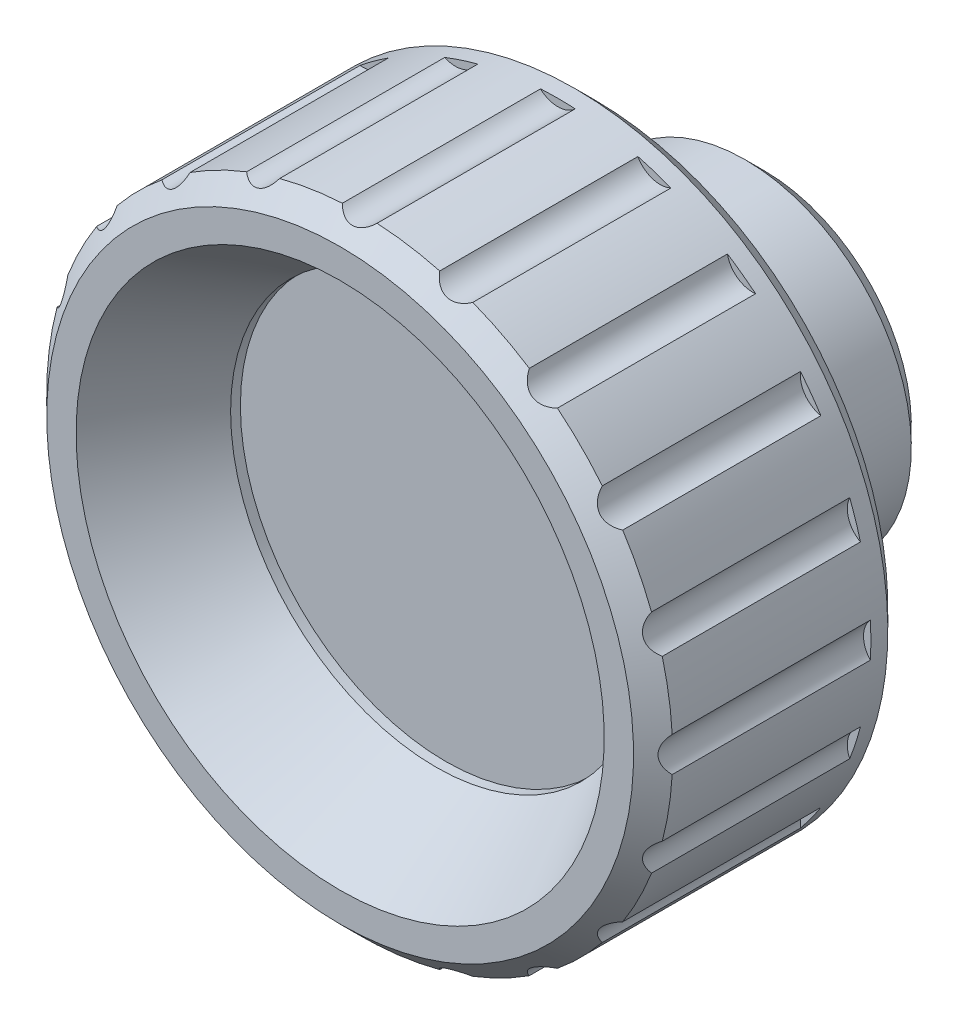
ISO-10303-21;
HEADER;
FILE_DESCRIPTION(('STEP AP214'),'2;1');
FILE_NAME('part.step','',(''),(''),'','','');
FILE_SCHEMA(('AUTOMOTIVE_DESIGN { 1 0 10303 214 1 1 1 1 }'));
ENDSEC;
DATA;
#1=APPLICATION_CONTEXT('core data for automotive mechanical design processes');
#2=APPLICATION_PROTOCOL_DEFINITION('international standard','automotive_design',2000,#1);
#3=PRODUCT_CONTEXT('',#1,'mechanical');
#4=PRODUCT('Part','Part','',(#3));
#5=PRODUCT_RELATED_PRODUCT_CATEGORY('part','',(#4));
#6=PRODUCT_DEFINITION_FORMATION('','',#4);
#7=PRODUCT_DEFINITION_CONTEXT('part definition',#1,'design');
#8=PRODUCT_DEFINITION('design','',#6,#7);
#9=PRODUCT_DEFINITION_SHAPE('','',#8);
#10=(LENGTH_UNIT() NAMED_UNIT(*) SI_UNIT(.MILLI.,.METRE.));
#11=(NAMED_UNIT(*) PLANE_ANGLE_UNIT() SI_UNIT($,.RADIAN.));
#12=(NAMED_UNIT(*) SI_UNIT($,.STERADIAN.) SOLID_ANGLE_UNIT());
#13=UNCERTAINTY_MEASURE_WITH_UNIT(LENGTH_MEASURE(1.E-05),#10,'distance_accuracy_value','');
#14=(GEOMETRIC_REPRESENTATION_CONTEXT(3) GLOBAL_UNCERTAINTY_ASSIGNED_CONTEXT((#13)) GLOBAL_UNIT_ASSIGNED_CONTEXT((#10,
#11,#12)) REPRESENTATION_CONTEXT('',''));
#15=CARTESIAN_POINT('',(0.,0.,0.));
#16=DIRECTION('',(0.,0.,1.));
#17=DIRECTION('',(1.,0.,0.));
#18=AXIS2_PLACEMENT_3D('',#15,#16,#17);
#19=CARTESIAN_POINT('',(-1.43127530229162E-12,7.46205088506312E-12,21.));
#20=DIRECTION('',(0.,-3.55335756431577E-13,-1.));
#21=DIRECTION('',(0.,1.,-3.55335756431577E-13));
#22=AXIS2_PLACEMENT_3D('',#19,#20,#21);
#23=CONICAL_SURFACE('',#22,16.,0.785398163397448);
#24=CARTESIAN_POINT('',(-1.49943126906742E-12,7.81738664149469E-12,22.));
#25=DIRECTION('',(0.,-3.55335756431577E-13,-1.));
#26=DIRECTION('',(0.,1.,-3.55335756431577E-13));
#27=AXIS2_PLACEMENT_3D('',#24,#25,#26);
#28=CIRCLE('',#27,15.);
#29=CARTESIAN_POINT('',(-1.49943126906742E-12,15.0000000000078,21.9999999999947));
#30=VERTEX_POINT('',#29);
#31=EDGE_CURVE('E584',#30,#30,#28,.T.);
#32=ORIENTED_EDGE('',*,*,#31,.T.);
#33=EDGE_LOOP('',(#32));
#34=FACE_BOUND('',#33,.T.);
#35=CARTESIAN_POINT('',(-1.43127530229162E-12,7.46205088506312E-12,21.));
#36=DIRECTION('',(0.,-3.55335756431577E-13,-1.));
#37=DIRECTION('',(0.,1.,-3.55335756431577E-13));
#38=AXIS2_PLACEMENT_3D('',#35,#36,#37);
#39=CIRCLE('',#38,16.);
#40=CARTESIAN_POINT('',(15.9753508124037,-0.887787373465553,21.0000000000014));
#41=VERTEX_POINT('',#40);
#42=CARTESIAN_POINT('',(15.4678028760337,-4.09231892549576,21.0000000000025));
#43=VERTEX_POINT('',#42);
#44=EDGE_CURVE('E589',#41,#43,#39,.T.);
#45=ORIENTED_EDGE('',*,*,#44,.F.);
#46=CARTESIAN_POINT('',(15.9755398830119,-0.887989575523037,20.9998000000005));
#47=CARTESIAN_POINT('',(15.9351784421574,-0.844826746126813,21.0424866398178));
#48=CARTESIAN_POINT('',(15.8966188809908,-0.797693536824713,21.0834537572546));
#49=CARTESIAN_POINT('',(15.8245769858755,-0.695019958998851,21.1602482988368));
#50=CARTESIAN_POINT('',(15.791150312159,-0.639398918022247,21.1960191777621));
#51=CARTESIAN_POINT('',(15.7380490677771,-0.532816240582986,21.2530008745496));
#52=CARTESIAN_POINT('',(15.7169614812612,-0.48337112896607,21.275690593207));
#53=CARTESIAN_POINT('',(15.6806455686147,-0.380207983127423,21.3148283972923));
#54=CARTESIAN_POINT('',(15.6653967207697,-0.326505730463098,21.3312983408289));
#55=CARTESIAN_POINT('',(15.6416857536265,-0.215315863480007,21.3569309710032));
#56=CARTESIAN_POINT('',(15.6332906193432,-0.157796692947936,21.366021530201));
#57=CARTESIAN_POINT('',(15.6243518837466,-0.0414082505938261,21.3757012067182));
#58=CARTESIAN_POINT('',(15.623808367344,0.0174610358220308,21.3762902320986));
#59=CARTESIAN_POINT('',(15.6301546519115,0.12624587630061,21.3694172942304));
#60=CARTESIAN_POINT('',(15.6360489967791,0.176295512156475,21.3630334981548));
#61=CARTESIAN_POINT('',(15.6532896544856,0.274274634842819,21.344383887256));
#62=CARTESIAN_POINT('',(15.6646343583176,0.322204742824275,21.33211980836));
#63=CARTESIAN_POINT('',(15.6925197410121,0.416525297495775,21.3020256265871));
#64=CARTESIAN_POINT('',(15.709218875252,0.462813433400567,21.2840259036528));
#65=CARTESIAN_POINT('',(15.7468524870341,0.551635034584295,21.2435491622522));
#66=CARTESIAN_POINT('',(15.7677958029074,0.594160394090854,21.2210628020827));
#67=CARTESIAN_POINT('',(15.8173070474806,0.682678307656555,21.168037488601));
#68=CARTESIAN_POINT('',(15.846568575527,0.727842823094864,21.1367787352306));
#69=CARTESIAN_POINT('',(15.9086393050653,0.812237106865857,21.0706895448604));
#70=CARTESIAN_POINT('',(15.9414255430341,0.851501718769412,21.0358822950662));
#71=CARTESIAN_POINT('',(15.9755398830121,0.887989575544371,20.9998));
#72=B_SPLINE_CURVE_WITH_KNOTS('',3,(#46,#47,#48,#49,#50,#51,#52,#53,#54,#55,#56,#57,#58,#59,#60,
#61,#62,#63,#64,#65,#66,#67,#68,#69,#70,#71),.UNSPECIFIED.,.F.,.F.,(4,2,2,2,2,2,2,2,2,2,2,2,4),
(0.,0.219100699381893,0.440431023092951,0.61478688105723,0.7885241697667,0.96393981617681,
1.13935735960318,1.29104866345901,1.44269521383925,1.59932369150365,1.75628175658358,
1.94245598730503,2.12748340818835),.UNSPECIFIED.);
#73=CARTESIAN_POINT('',(15.9753508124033,0.887787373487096,21.0000000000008));
#74=VERTEX_POINT('',#73);
#75=EDGE_CURVE('E590',#41,#74,#72,.T.);
#76=ORIENTED_EDGE('',*,*,#75,.T.);
#77=CARTESIAN_POINT('',(15.467802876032,4.09231892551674,20.9999999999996));
#78=VERTEX_POINT('',#77);
#79=EDGE_CURVE('E593',#78,#74,#39,.T.);
#80=ORIENTED_EDGE('',*,*,#79,.F.);
#81=CARTESIAN_POINT('',(15.4680028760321,4.09220841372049,20.9998349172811));
#82=CARTESIAN_POINT('',(15.4162815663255,4.12078731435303,21.0425185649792));
#83=CARTESIAN_POINT('',(15.3650471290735,4.15369881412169,21.0834826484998));
#84=CARTESIAN_POINT('',(15.2648091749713,4.22908574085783,21.1602711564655));
#85=CARTESIAN_POINT('',(15.2158336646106,4.27165508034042,21.1960390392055));
#86=CARTESIAN_POINT('',(15.1323998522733,4.35661227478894,21.2530163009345));
#87=CARTESIAN_POINT('',(15.0970664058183,4.39712151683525,21.2757043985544));
#88=CARTESIAN_POINT('',(15.030651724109,4.48401408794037,21.3148389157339));
#89=CARTESIAN_POINT('',(14.9995558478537,4.530376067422,21.3313071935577));
#90=CARTESIAN_POINT('',(14.9426490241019,4.62879687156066,21.3569365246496));
#91=CARTESIAN_POINT('',(14.9168920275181,4.68090639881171,21.3660254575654));
#92=CARTESIAN_POINT('',(14.8724279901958,4.78883525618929,21.3757021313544));
#93=CARTESIAN_POINT('',(14.8537210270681,4.84465462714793,21.3762897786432));
#94=CARTESIAN_POINT('',(14.8261428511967,4.95007522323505,21.3694146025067));
#95=CARTESIAN_POINT('',(14.8162835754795,4.9994964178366,21.363029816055));
#96=CARTESIAN_POINT('',(14.8024051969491,5.09800697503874,21.3443784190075));
#97=CARTESIAN_POINT('',(14.7983843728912,5.14709643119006,21.3321135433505));
#98=CARTESIAN_POINT('',(14.7957600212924,5.2454174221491,21.302017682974));
#99=CARTESIAN_POINT('',(14.7973389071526,5.29460058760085,21.2840169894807));
#100=CARTESIAN_POINT('',(14.8056849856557,5.39070462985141,21.243538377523));
#101=CARTESIAN_POINT('',(14.8124630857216,5.43762052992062,21.2210511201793));
#102=CARTESIAN_POINT('',(14.8321965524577,5.53709129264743,21.1680316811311));
#103=CARTESIAN_POINT('',(14.8460657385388,5.58907402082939,21.1367810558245));
#104=CARTESIAN_POINT('',(14.8790094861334,5.6884938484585,21.0707098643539));
#105=CARTESIAN_POINT('',(14.8980514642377,5.73595697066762,21.0359124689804));
#106=CARTESIAN_POINT('',(14.9192136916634,5.78119085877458,20.9998404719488));
#107=B_SPLINE_CURVE_WITH_KNOTS('',3,(#81,#82,#83,#84,#85,#86,#87,#88,#89,#90,#91,#92,#93,#94,
#95,#96,#97,#98,#99,#100,#101,#102,#103,#104,#105,#106),.UNSPECIFIED.,.F.,.F.,(4,2,2,2,2,2,2,2,
2,2,2,2,4),(0.,0.219090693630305,0.440410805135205,0.614763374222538,0.788497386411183,
0.963909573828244,1.13932369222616,1.29101393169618,1.44265944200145,1.59928961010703,
1.75624927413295,1.94237523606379,2.12735493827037),.UNSPECIFIED.);
#108=CARTESIAN_POINT('',(14.9191201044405,5.78099085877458,20.9999999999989));
#109=VERTEX_POINT('',#108);
#110=EDGE_CURVE('E276',#78,#109,#107,.T.);
#111=ORIENTED_EDGE('',*,*,#110,.T.);
#112=CARTESIAN_POINT('',(13.4461586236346,8.67184053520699,20.9999999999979));
#113=VERTEX_POINT('',#112);
#114=EDGE_CURVE('E596',#113,#109,#39,.T.);
#115=ORIENTED_EDGE('',*,*,#114,.F.);
#116=CARTESIAN_POINT('',(13.4463586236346,8.6718019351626,20.9998528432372));
#117=CARTESIAN_POINT('',(13.3883385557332,8.68300023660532,21.0425349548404));
#118=CARTESIAN_POINT('',(13.329442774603,8.69846942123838,21.0834974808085));
#119=CARTESIAN_POINT('',(13.2108177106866,8.73919269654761,21.1602828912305));
#120=CARTESIAN_POINT('',(13.151086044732,8.76454475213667,21.1960492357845));
#121=CARTESIAN_POINT('',(13.045484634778,8.81956217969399,21.2530242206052));
#122=CARTESIAN_POINT('',(12.9993630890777,8.84717062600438,21.275711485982));
#123=CARTESIAN_POINT('',(12.9093490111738,8.90928797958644,21.3148443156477));
#124=CARTESIAN_POINT('',(12.865449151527,8.94377205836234,21.3313117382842));
#125=CARTESIAN_POINT('',(12.7809154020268,9.0197911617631,21.3569393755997));
#126=CARTESIAN_POINT('',(12.7403171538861,9.06139107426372,21.3660274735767));
#127=CARTESIAN_POINT('',(12.6646792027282,9.15029744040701,21.3757026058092));
#128=CARTESIAN_POINT('',(12.6296395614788,9.19760395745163,21.3762895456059));
#129=CARTESIAN_POINT('',(12.5708357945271,9.28934266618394,21.3694132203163));
#130=CARTESIAN_POINT('',(12.5461876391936,9.33329835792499,21.3630279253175));
#131=CARTESIAN_POINT('',(12.5025481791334,9.42269874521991,21.3443756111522));
#132=CARTESIAN_POINT('',(12.4835552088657,9.46814299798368,21.3321103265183));
#133=CARTESIAN_POINT('',(12.4506773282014,9.56084100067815,21.3020136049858));
#134=CARTESIAN_POINT('',(12.4369809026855,9.6081051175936,21.2840124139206));
#135=CARTESIAN_POINT('',(12.4152215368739,9.70208497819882,21.2435328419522));
#136=CARTESIAN_POINT('',(12.4071705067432,9.7487993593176,21.2210451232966));
#137=CARTESIAN_POINT('',(12.3952016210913,9.84949409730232,21.168027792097));
#138=CARTESIAN_POINT('',(12.3923288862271,9.9032128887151,21.1367802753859));
#139=CARTESIAN_POINT('',(12.3929374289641,10.0079364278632,21.0707160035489));
#140=CARTESIAN_POINT('',(12.3963796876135,10.0589558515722,21.0359224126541));
#141=CARTESIAN_POINT('',(12.4025267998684,10.1085106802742,20.9998544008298));
#142=B_SPLINE_CURVE_WITH_KNOTS('',3,(#116,#117,#118,#119,#120,#121,#122,#123,#124,#125,#126,
#127,#128,#129,#130,#131,#132,#133,#134,#135,#136,#137,#138,#139,#140,#141),.UNSPECIFIED.,.F.,
.F.,(4,2,2,2,2,2,2,2,2,2,2,2,4),(0.,0.21908555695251,0.440400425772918,0.61475130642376,
0.788483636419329,0.963894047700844,1.1393064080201,1.29099610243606,1.4426410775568,
1.59927210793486,1.75623259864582,1.94233964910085,2.12730065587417),.UNSPECIFIED.);
#143=CARTESIAN_POINT('',(12.4025019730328,10.1083106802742,20.9999999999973));
#144=VERTEX_POINT('',#143);
#145=EDGE_CURVE('E517',#113,#144,#142,.T.);
#146=ORIENTED_EDGE('',*,*,#145,.T.);
#147=CARTESIAN_POINT('',(10.1083106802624,12.4025019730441,20.9999999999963));
#148=VERTEX_POINT('',#147);
#149=EDGE_CURVE('E1303',#148,#144,#39,.T.);
#150=ORIENTED_EDGE('',*,*,#149,.F.);
#151=CARTESIAN_POINT('',(10.1085106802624,12.4025267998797,20.9998544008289));
#152=CARTESIAN_POINT('',(10.0498699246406,12.3952479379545,21.042536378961));
#153=CARTESIAN_POINT('',(9.9890765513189,12.3917603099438,21.0834987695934));
#154=CARTESIAN_POINT('',(9.86367341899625,12.3938334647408,21.1602839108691));
#155=CARTESIAN_POINT('',(9.79903112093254,12.3994866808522,21.1960501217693));
#156=CARTESIAN_POINT('',(9.68159704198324,12.4191788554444,21.2530249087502));
#157=CARTESIAN_POINT('',(9.62920140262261,12.4311837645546,21.2757121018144));
#158=CARTESIAN_POINT('',(9.52439769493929,12.4624451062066,21.3148447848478));
#159=CARTESIAN_POINT('',(9.47199033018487,12.4816756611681,21.3313121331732));
#160=CARTESIAN_POINT('',(9.36810287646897,12.527851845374,21.3569396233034));
#161=CARTESIAN_POINT('',(9.31663663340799,12.5548702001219,21.3660276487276));
#162=CARTESIAN_POINT('',(9.21722722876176,12.6160518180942,21.3757026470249));
#163=CARTESIAN_POINT('',(9.16928410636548,12.6502151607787,21.3762895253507));
#164=CARTESIAN_POINT('',(9.08500969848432,12.7192925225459,21.3694131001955));
#165=CARTESIAN_POINT('',(9.04798489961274,12.7534801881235,21.3630277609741));
#166=CARTESIAN_POINT('',(8.97885516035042,12.825019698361,21.3443753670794));
#167=CARTESIAN_POINT('',(8.94674877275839,12.8623706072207,21.3321100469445));
#168=CARTESIAN_POINT('',(8.8868348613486,12.9403718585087,21.3020132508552));
#169=CARTESIAN_POINT('',(8.85920339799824,12.9810903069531,21.2840120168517));
#170=CARTESIAN_POINT('',(8.80946769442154,13.0637465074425,21.243532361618));
#171=CARTESIAN_POINT('',(8.78737520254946,13.1056866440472,21.2210446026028));
#172=CARTESIAN_POINT('',(8.74487571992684,13.1977546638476,21.1680270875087));
#173=CARTESIAN_POINT('',(8.72554355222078,13.247956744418,21.1367794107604));
#174=CARTESIAN_POINT('',(8.69376097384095,13.3477431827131,21.0707148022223));
#175=CARTESIAN_POINT('',(8.68126891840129,13.3973294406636,21.0359210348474));
#176=CARTESIAN_POINT('',(8.67180193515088,13.4463586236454,20.9998528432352));
#177=B_SPLINE_CURVE_WITH_KNOTS('',3,(#151,#152,#153,#154,#155,#156,#157,#158,#159,#160,#161,
#162,#163,#164,#165,#166,#167,#168,#169,#170,#171,#172,#173,#174,#175,#176),.UNSPECIFIED.,.F.,
.F.,(4,2,2,2,2,2,2,2,2,2,2,2,4),(0.,0.219085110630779,0.440399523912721,0.614750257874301,
0.788482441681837,0.963892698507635,1.13930490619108,1.29099455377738,1.44263948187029,
1.599270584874,1.75623114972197,1.94233892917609,2.12730065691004),.UNSPECIFIED.);
#178=CARTESIAN_POINT('',(8.67184053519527,13.4461586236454,20.9999999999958));
#179=VERTEX_POINT('',#178);
#180=EDGE_CURVE('E1293',#148,#179,#177,.T.);
#181=ORIENTED_EDGE('',*,*,#180,.T.);
#182=CARTESIAN_POINT('',(5.78099085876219,14.9191201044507,20.9999999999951));
#183=VERTEX_POINT('',#182);
#184=EDGE_CURVE('E603',#183,#179,#39,.T.);
#185=ORIENTED_EDGE('',*,*,#184,.F.);
#186=CARTESIAN_POINT('',(5.78119085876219,14.9192136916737,20.9998404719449));
#187=CARTESIAN_POINT('',(5.72766915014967,14.8941689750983,21.0425236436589));
#188=CARTESIAN_POINT('',(5.67092851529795,14.872064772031,21.0834872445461));
#189=CARTESIAN_POINT('',(5.5510212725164,14.8352827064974,21.1602747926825));
#190=CARTESIAN_POINT('',(5.48779515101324,14.8206827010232,21.1960421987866));
#191=CARTESIAN_POINT('',(5.37002254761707,14.8031204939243,21.2530187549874));
#192=CARTESIAN_POINT('',(5.31648146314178,14.7983461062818,21.2757065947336));
#193=CARTESIAN_POINT('',(5.20714649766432,14.7956901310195,21.3148405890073));
#194=CARTESIAN_POINT('',(5.15136128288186,14.7977841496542,21.3313086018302));
#195=CARTESIAN_POINT('',(5.03828848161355,14.8095962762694,21.3569374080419));
#196=CARTESIAN_POINT('',(4.98099158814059,14.8193878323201,21.3660260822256));
#197=CARTESIAN_POINT('',(4.86754042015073,14.8468549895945,21.3757022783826));
#198=CARTESIAN_POINT('',(4.81138615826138,14.8645306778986,21.3762897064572));
#199=CARTESIAN_POINT('',(4.7098894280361,14.9041843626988,21.3694141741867));
#200=CARTESIAN_POINT('',(4.66411184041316,14.9252571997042,21.3630292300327));
#201=CARTESIAN_POINT('',(4.5762579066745,14.971932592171,21.344377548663));
#202=CARTESIAN_POINT('',(4.53418047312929,14.9975338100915,21.3321125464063));
#203=CARTESIAN_POINT('',(4.45309476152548,15.0532024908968,21.3020164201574));
#204=CARTESIAN_POINT('',(4.41423284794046,15.0833891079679,21.2840155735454));
#205=CARTESIAN_POINT('',(4.3413888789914,15.1466300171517,21.2435366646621));
#206=CARTESIAN_POINT('',(4.30741726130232,15.1796902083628,21.2210492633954));
#207=CARTESIAN_POINT('',(4.2385424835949,15.2541231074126,21.1680291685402));
#208=CARTESIAN_POINT('',(4.20463940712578,15.2958988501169,21.136777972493));
#209=CARTESIAN_POINT('',(4.1435705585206,15.3809897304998,21.0707055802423));
#210=CARTESIAN_POINT('',(4.11636458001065,15.4242938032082,21.0359075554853));
#211=CARTESIAN_POINT('',(4.09220841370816,15.4680028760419,20.9998349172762));
#212=B_SPLINE_CURVE_WITH_KNOTS('',3,(#186,#187,#188,#189,#190,#191,#192,#193,#194,#195,#196,
#197,#198,#199,#200,#201,#202,#203,#204,#205,#206,#207,#208,#209,#210,#211),.UNSPECIFIED.,.F.,
.F.,(4,2,2,2,2,2,2,2,2,2,2,2,4),(0.,0.21908910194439,0.440407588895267,0.614759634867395,
0.78849312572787,0.963904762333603,1.13931833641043,1.29100840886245,1.44265375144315,
1.59928417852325,1.7562441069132,1.9423726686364,2.12735494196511),.UNSPECIFIED.);
#213=CARTESIAN_POINT('',(4.09231892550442,15.4678028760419,20.9999999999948));
#214=VERTEX_POINT('',#213);
#215=EDGE_CURVE('E1285',#183,#214,#212,.T.);
#216=ORIENTED_EDGE('',*,*,#215,.T.);
#217=CARTESIAN_POINT('',(0.887787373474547,15.9753508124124,20.9999999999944));
#218=VERTEX_POINT('',#217);
#219=EDGE_CURVE('E599',#218,#214,#39,.T.);
#220=ORIENTED_EDGE('',*,*,#219,.F.);
#221=CARTESIAN_POINT('',(0.887987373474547,15.9755378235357,20.9998021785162));
#222=CARTESIAN_POINT('',(0.844824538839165,15.9351765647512,21.0424886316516));
#223=CARTESIAN_POINT('',(0.797691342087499,15.8966171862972,21.0834555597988));
#224=CARTESIAN_POINT('',(0.695017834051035,15.8245756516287,21.1602497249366));
#225=CARTESIAN_POINT('',(0.639396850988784,15.7911491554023,21.1960204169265));
#226=CARTESIAN_POINT('',(0.532814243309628,15.7380481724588,21.2530018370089));
#227=CARTESIAN_POINT('',(0.483369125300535,15.716960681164,21.2756914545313));
#228=CARTESIAN_POINT('',(0.380205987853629,15.6806449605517,21.3148290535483));
#229=CARTESIAN_POINT('',(0.326503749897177,15.665396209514,21.3312988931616));
#230=CARTESIAN_POINT('',(0.215313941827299,15.6416854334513,21.3569313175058));
#231=CARTESIAN_POINT('',(0.157794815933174,15.6332903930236,21.3660217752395));
#232=CARTESIAN_POINT('',(0.0414064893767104,15.6243518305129,21.3757012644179));
#233=CARTESIAN_POINT('',(-0.0174627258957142,15.6238083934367,21.3762902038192));
#234=CARTESIAN_POINT('',(-0.1262474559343,15.6301548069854,21.3694171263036));
#235=CARTESIAN_POINT('',(-0.176297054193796,15.6360492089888,21.3630332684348));
#236=CARTESIAN_POINT('',(-0.274276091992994,15.6532899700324,21.3443835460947));
#237=CARTESIAN_POINT('',(-0.322206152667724,15.664634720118,21.332119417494));
#238=CARTESIAN_POINT('',(-0.416526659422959,15.6925202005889,21.3020251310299));
#239=CARTESIAN_POINT('',(-0.462814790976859,15.7092193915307,21.2840253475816));
#240=CARTESIAN_POINT('',(-0.551636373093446,15.7468531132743,21.2435484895));
#241=CARTESIAN_POINT('',(-0.594161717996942,15.7677964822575,21.2210620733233));
#242=CARTESIAN_POINT('',(-0.682678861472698,15.8173074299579,21.1680370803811));
#243=CARTESIAN_POINT('',(-0.72784270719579,15.8465685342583,21.1367787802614));
#244=CARTESIAN_POINT('',(-0.812235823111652,15.9086383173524,21.0706905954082));
#245=CARTESIAN_POINT('',(-0.851499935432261,15.9414240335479,21.0358838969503));
#246=CARTESIAN_POINT('',(-0.887987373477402,15.9755378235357,20.999802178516));
#247=B_SPLINE_CURVE_WITH_KNOTS('',3,(#221,#222,#223,#224,#225,#226,#227,#228,#229,#230,#231,
#232,#233,#234,#235,#236,#237,#238,#239,#240,#241,#242,#243,#244,#245,#246),.UNSPECIFIED.,.F.,
.F.,(4,2,2,2,2,2,2,2,2,2,2,2,4),(0.,0.219100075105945,0.440429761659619,0.614785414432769,
0.788522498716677,0.963937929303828,1.13935525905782,1.29104649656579,1.44269298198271,
1.59932156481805,1.75627972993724,1.94245124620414,2.12747598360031),.UNSPECIFIED.);
#248=CARTESIAN_POINT('',(-0.887787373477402,15.9753508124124,20.9999999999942));
#249=VERTEX_POINT('',#248);
#250=EDGE_CURVE('E1278',#218,#249,#247,.T.);
#251=ORIENTED_EDGE('',*,*,#250,.T.);
#252=CARTESIAN_POINT('',(-4.09231892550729,15.4678028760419,20.9999999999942));
#253=VERTEX_POINT('',#252);
#254=EDGE_CURVE('E604',#253,#249,#39,.T.);
#255=ORIENTED_EDGE('',*,*,#254,.F.);
#256=CARTESIAN_POINT('',(-4.09220841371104,15.4680028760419,20.9998349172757));
#257=CARTESIAN_POINT('',(-4.12078731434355,15.4162815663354,21.0425185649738));
#258=CARTESIAN_POINT('',(-4.15369881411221,15.3650471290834,21.0834826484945));
#259=CARTESIAN_POINT('',(-4.22908574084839,15.2648091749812,21.1602711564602));
#260=CARTESIAN_POINT('',(-4.271655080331,15.2158336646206,21.1960390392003));
#261=CARTESIAN_POINT('',(-4.35661227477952,15.1323998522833,21.2530163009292));
#262=CARTESIAN_POINT('',(-4.39712151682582,15.0970664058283,21.2757043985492));
#263=CARTESIAN_POINT('',(-4.48401408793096,15.0306517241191,21.3148389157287));
#264=CARTESIAN_POINT('',(-4.53037606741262,14.9995558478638,21.3313071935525));
#265=CARTESIAN_POINT('',(-4.6287968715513,14.942649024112,21.3569365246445));
#266=CARTESIAN_POINT('',(-4.68090639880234,14.9168920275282,21.3660254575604));
#267=CARTESIAN_POINT('',(-4.78883525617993,14.872427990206,21.3757021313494));
#268=CARTESIAN_POINT('',(-4.84465462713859,14.8537210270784,21.3762897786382));
#269=CARTESIAN_POINT('',(-4.95007522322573,14.826142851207,21.3694146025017));
#270=CARTESIAN_POINT('',(-4.99949641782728,14.8162835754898,21.3630298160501));
#271=CARTESIAN_POINT('',(-5.09800697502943,14.8024051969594,21.3443784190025));
#272=CARTESIAN_POINT('',(-5.14709643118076,14.7983843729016,21.3321135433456));
#273=CARTESIAN_POINT('',(-5.24541742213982,14.7957600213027,21.3020176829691));
#274=CARTESIAN_POINT('',(-5.29460058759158,14.797338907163,21.2840169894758));
#275=CARTESIAN_POINT('',(-5.39070462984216,14.805684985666,21.2435383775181));
#276=CARTESIAN_POINT('',(-5.43762052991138,14.8124630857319,21.2210511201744));
#277=CARTESIAN_POINT('',(-5.53709129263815,14.832196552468,21.1680316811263));
#278=CARTESIAN_POINT('',(-5.58907402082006,14.8460657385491,21.1367810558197));
#279=CARTESIAN_POINT('',(-5.68849384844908,14.8790094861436,21.0707098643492));
#280=CARTESIAN_POINT('',(-5.73595697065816,14.8980514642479,21.0359124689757));
#281=CARTESIAN_POINT('',(-5.78119085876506,14.9192136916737,20.9998404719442));
#282=B_SPLINE_CURVE_WITH_KNOTS('',3,(#256,#257,#258,#259,#260,#261,#262,#263,#264,#265,#266,
#267,#268,#269,#270,#271,#272,#273,#274,#275,#276,#277,#278,#279,#280,#281),.UNSPECIFIED.,.F.,
.F.,(4,2,2,2,2,2,2,2,2,2,2,2,4),(0.,0.219090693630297,0.440410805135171,0.614763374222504,
0.788497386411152,0.96390957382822,1.13932369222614,1.29101393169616,1.44265944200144,
1.59928961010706,1.75624927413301,1.94237523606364,2.12735493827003),.UNSPECIFIED.);
#283=CARTESIAN_POINT('',(-5.78099085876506,14.9191201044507,20.9999999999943));
#284=VERTEX_POINT('',#283);
#285=EDGE_CURVE('E1271',#253,#284,#282,.T.);
#286=ORIENTED_EDGE('',*,*,#285,.T.);
#287=CARTESIAN_POINT('',(-8.67184053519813,13.4461586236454,20.9999999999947));
#288=VERTEX_POINT('',#287);
#289=EDGE_CURVE('E1140',#288,#284,#39,.T.);
#290=ORIENTED_EDGE('',*,*,#289,.F.);
#291=CARTESIAN_POINT('',(-8.67180193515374,13.4463586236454,20.999852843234));
#292=CARTESIAN_POINT('',(-8.68300023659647,13.3883385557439,21.0425349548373));
#293=CARTESIAN_POINT('',(-8.69846942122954,13.3294427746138,21.0834974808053));
#294=CARTESIAN_POINT('',(-8.73919269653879,13.2108177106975,21.1602828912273));
#295=CARTESIAN_POINT('',(-8.76454475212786,13.1510860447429,21.1960492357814));
#296=CARTESIAN_POINT('',(-8.81956217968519,13.0454846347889,21.253024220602));
#297=CARTESIAN_POINT('',(-8.84717062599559,12.9993630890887,21.2757114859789));
#298=CARTESIAN_POINT('',(-8.90928797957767,12.9093490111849,21.3148443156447));
#299=CARTESIAN_POINT('',(-8.94377205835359,12.8654491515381,21.3313117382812));
#300=CARTESIAN_POINT('',(-9.01979116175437,12.780915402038,21.3569393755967));
#301=CARTESIAN_POINT('',(-9.06139107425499,12.7403171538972,21.3660274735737));
#302=CARTESIAN_POINT('',(-9.1502974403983,12.6646792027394,21.3757026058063));
#303=CARTESIAN_POINT('',(-9.19760395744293,12.62963956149,21.376289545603));
#304=CARTESIAN_POINT('',(-9.28934266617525,12.5708357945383,21.3694132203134));
#305=CARTESIAN_POINT('',(-9.3332983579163,12.5461876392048,21.3630279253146));
#306=CARTESIAN_POINT('',(-9.42269874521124,12.5025481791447,21.3443756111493));
#307=CARTESIAN_POINT('',(-9.46814299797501,12.483555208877,21.3321103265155));
#308=CARTESIAN_POINT('',(-9.56084100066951,12.4506773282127,21.302013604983));
#309=CARTESIAN_POINT('',(-9.60810511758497,12.4369809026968,21.2840124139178));
#310=CARTESIAN_POINT('',(-9.70208497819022,12.4152215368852,21.2435328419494));
#311=CARTESIAN_POINT('',(-9.74879935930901,12.4071705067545,21.2210451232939));
#312=CARTESIAN_POINT('',(-9.84949409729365,12.3952016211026,21.1680277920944));
#313=CARTESIAN_POINT('',(-9.90321288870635,12.3923288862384,21.1367802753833));
#314=CARTESIAN_POINT('',(-10.0079364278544,12.3929374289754,21.0707160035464));
#315=CARTESIAN_POINT('',(-10.0589558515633,12.3963796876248,21.0359224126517));
#316=CARTESIAN_POINT('',(-10.1085106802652,12.4025267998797,20.9998544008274));
#317=B_SPLINE_CURVE_WITH_KNOTS('',3,(#291,#292,#293,#294,#295,#296,#297,#298,#299,#300,#301,
#302,#303,#304,#305,#306,#307,#308,#309,#310,#311,#312,#313,#314,#315,#316),.UNSPECIFIED.,.F.,
.F.,(4,2,2,2,2,2,2,2,2,2,2,2,4),(0.,0.21908555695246,0.440400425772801,0.614751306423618,
0.78848363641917,0.96389404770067,1.13930640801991,1.29099610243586,1.4426410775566,
1.59927210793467,1.75623259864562,1.94233964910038,2.12730065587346),.UNSPECIFIED.);
#318=CARTESIAN_POINT('',(-10.1083106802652,12.4025019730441,20.9999999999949));
#319=VERTEX_POINT('',#318);
#320=EDGE_CURVE('E1264',#288,#319,#317,.T.);
#321=ORIENTED_EDGE('',*,*,#320,.T.);
#322=CARTESIAN_POINT('',(-12.402501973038,10.1083106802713,20.9999999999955));
#323=VERTEX_POINT('',#322);
#324=EDGE_CURVE('E1143',#323,#319,#39,.T.);
#325=ORIENTED_EDGE('',*,*,#324,.F.);
#326=CARTESIAN_POINT('',(-12.4025267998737,10.1085106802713,20.9998544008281));
#327=CARTESIAN_POINT('',(-12.3952479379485,10.0498699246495,21.0425363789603));
#328=CARTESIAN_POINT('',(-12.3917603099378,9.98907655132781,21.0834987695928));
#329=CARTESIAN_POINT('',(-12.3938334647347,9.86367341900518,21.1602839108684));
#330=CARTESIAN_POINT('',(-12.3994866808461,9.79903112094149,21.1960501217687));
#331=CARTESIAN_POINT('',(-12.4191788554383,9.6815970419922,21.2530249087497));
#332=CARTESIAN_POINT('',(-12.4311837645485,9.62920140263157,21.2757121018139));
#333=CARTESIAN_POINT('',(-12.4624451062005,9.52439769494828,21.3148447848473));
#334=CARTESIAN_POINT('',(-12.481675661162,9.47199033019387,21.3313121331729));
#335=CARTESIAN_POINT('',(-12.5278518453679,9.36810287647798,21.356939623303));
#336=CARTESIAN_POINT('',(-12.5548702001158,9.316636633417,21.3660276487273));
#337=CARTESIAN_POINT('',(-12.6160518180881,9.21722722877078,21.3757026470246));
#338=CARTESIAN_POINT('',(-12.6502151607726,9.1692841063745,21.3762895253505));
#339=CARTESIAN_POINT('',(-12.7192925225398,9.08500969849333,21.3694131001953));
#340=CARTESIAN_POINT('',(-12.7534801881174,9.04798489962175,21.363027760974));
#341=CARTESIAN_POINT('',(-12.8250196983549,8.97885516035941,21.3443753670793));
#342=CARTESIAN_POINT('',(-12.8623706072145,8.94674877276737,21.3321100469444));
#343=CARTESIAN_POINT('',(-12.9403718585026,8.88683486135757,21.3020132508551));
#344=CARTESIAN_POINT('',(-12.9810903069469,8.8592033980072,21.2840120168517));
#345=CARTESIAN_POINT('',(-13.0637465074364,8.8094676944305,21.243532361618));
#346=CARTESIAN_POINT('',(-13.1056866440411,8.78737520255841,21.2210446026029));
#347=CARTESIAN_POINT('',(-13.1977546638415,8.74487571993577,21.1680270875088));
#348=CARTESIAN_POINT('',(-13.247956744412,8.72554355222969,21.1367794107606));
#349=CARTESIAN_POINT('',(-13.347743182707,8.69376097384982,21.0707148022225));
#350=CARTESIAN_POINT('',(-13.3973294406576,8.68126891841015,21.0359210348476));
#351=CARTESIAN_POINT('',(-13.4463586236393,8.67180193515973,20.9998528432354));
#352=B_SPLINE_CURVE_WITH_KNOTS('',3,(#326,#327,#328,#329,#330,#331,#332,#333,#334,#335,#336,
#337,#338,#339,#340,#341,#342,#343,#344,#345,#346,#347,#348,#349,#350,#351),.UNSPECIFIED.,.F.,
.F.,(4,2,2,2,2,2,2,2,2,2,2,2,4),(0.,0.219085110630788,0.440399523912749,0.614750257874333,
0.788482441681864,0.963892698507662,1.13930490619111,1.29099455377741,1.44263948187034,
1.59927058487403,1.75623114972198,1.94233892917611,2.12730065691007),.UNSPECIFIED.);
#353=CARTESIAN_POINT('',(-13.4461586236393,8.67184053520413,20.999999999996));
#354=VERTEX_POINT('',#353);
#355=EDGE_CURVE('E1254',#323,#354,#352,.T.);
#356=ORIENTED_EDGE('',*,*,#355,.T.);
#357=CARTESIAN_POINT('',(-14.9191201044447,5.78099085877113,20.999999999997));
#358=VERTEX_POINT('',#357);
#359=EDGE_CURVE('E1146',#358,#354,#39,.T.);
#360=ORIENTED_EDGE('',*,*,#359,.F.);
#361=CARTESIAN_POINT('',(-14.9192136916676,5.78119085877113,20.9998404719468));
#362=CARTESIAN_POINT('',(-14.8941689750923,5.7276691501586,21.0425236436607));
#363=CARTESIAN_POINT('',(-14.8720647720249,5.6709285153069,21.0834872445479));
#364=CARTESIAN_POINT('',(-14.8352827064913,5.5510212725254,21.1602747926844));
#365=CARTESIAN_POINT('',(-14.8206827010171,5.48779515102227,21.1960421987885));
#366=CARTESIAN_POINT('',(-14.8031204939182,5.37002254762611,21.2530187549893));
#367=CARTESIAN_POINT('',(-14.7983461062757,5.31648146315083,21.2757065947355));
#368=CARTESIAN_POINT('',(-14.7956901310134,5.20714649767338,21.3148405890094));
#369=CARTESIAN_POINT('',(-14.797784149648,5.15136128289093,21.3313086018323));
#370=CARTESIAN_POINT('',(-14.8095962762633,5.03828848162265,21.356937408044));
#371=CARTESIAN_POINT('',(-14.819387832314,4.9809915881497,21.3660260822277));
#372=CARTESIAN_POINT('',(-14.8468549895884,4.86754042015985,21.3757022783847));
#373=CARTESIAN_POINT('',(-14.8645306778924,4.81138615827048,21.3762897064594));
#374=CARTESIAN_POINT('',(-14.9041843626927,4.70988942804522,21.369414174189));
#375=CARTESIAN_POINT('',(-14.9252571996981,4.66411184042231,21.363029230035));
#376=CARTESIAN_POINT('',(-14.9719325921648,4.57625790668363,21.3443775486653));
#377=CARTESIAN_POINT('',(-14.9975338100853,4.53418047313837,21.3321125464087));
#378=CARTESIAN_POINT('',(-15.0532024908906,4.45309476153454,21.3020164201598));
#379=CARTESIAN_POINT('',(-15.0833891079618,4.41423284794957,21.2840155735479));
#380=CARTESIAN_POINT('',(-15.1466300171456,4.3413888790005,21.2435366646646));
#381=CARTESIAN_POINT('',(-15.1796902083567,4.30741726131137,21.2210492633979));
#382=CARTESIAN_POINT('',(-15.2541231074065,4.2385424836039,21.1680291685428));
#383=CARTESIAN_POINT('',(-15.2958988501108,4.20463940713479,21.1367779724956));
#384=CARTESIAN_POINT('',(-15.3809897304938,4.14357055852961,21.0707055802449));
#385=CARTESIAN_POINT('',(-15.4242938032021,4.11636458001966,21.0359075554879));
#386=CARTESIAN_POINT('',(-15.4680028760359,4.0922084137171,20.9998349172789));
#387=B_SPLINE_CURVE_WITH_KNOTS('',3,(#361,#362,#363,#364,#365,#366,#367,#368,#369,#370,#371,
#372,#373,#374,#375,#376,#377,#378,#379,#380,#381,#382,#383,#384,#385,#386),.UNSPECIFIED.,.F.,
.F.,(4,2,2,2,2,2,2,2,2,2,2,2,4),(0.,0.219089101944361,0.440407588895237,0.614759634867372,
0.788493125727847,0.963904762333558,1.13931833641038,1.29100840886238,1.44265375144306,
1.59928417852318,1.75624410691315,1.94237266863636,2.12735494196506),.UNSPECIFIED.);
#388=CARTESIAN_POINT('',(-15.4678028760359,4.09231892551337,20.9999999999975));
#389=VERTEX_POINT('',#388);
#390=EDGE_CURVE('E1247',#358,#389,#387,.T.);
#391=ORIENTED_EDGE('',*,*,#390,.T.);
#392=CARTESIAN_POINT('',(-15.9753508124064,0.887787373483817,20.9999999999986));
#393=VERTEX_POINT('',#392);
#394=EDGE_CURVE('E1149',#393,#389,#39,.T.);
#395=ORIENTED_EDGE('',*,*,#394,.F.);
#396=CARTESIAN_POINT('',(-15.9755398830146,0.887989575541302,20.9997999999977));
#397=CARTESIAN_POINT('',(-15.9351784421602,0.84482674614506,21.042486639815));
#398=CARTESIAN_POINT('',(-15.8966188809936,0.797693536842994,21.0834537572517));
#399=CARTESIAN_POINT('',(-15.8245769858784,0.695019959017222,21.160248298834));
#400=CARTESIAN_POINT('',(-15.791150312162,0.639398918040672,21.1960191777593));
#401=CARTESIAN_POINT('',(-15.7380490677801,0.53281624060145,21.2530008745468));
#402=CARTESIAN_POINT('',(-15.7169614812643,0.483371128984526,21.2756905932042));
#403=CARTESIAN_POINT('',(-15.6806455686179,0.380207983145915,21.3148283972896));
#404=CARTESIAN_POINT('',(-15.6653967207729,0.326505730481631,21.3312983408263));
#405=CARTESIAN_POINT('',(-15.6416857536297,0.215315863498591,21.3569309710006));
#406=CARTESIAN_POINT('',(-15.6332906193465,0.157796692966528,21.3660215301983));
#407=CARTESIAN_POINT('',(-15.62435188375,0.0414082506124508,21.3757012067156));
#408=CARTESIAN_POINT('',(-15.6238083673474,-0.0174610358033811,21.376290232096));
#409=CARTESIAN_POINT('',(-15.6301546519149,-0.126245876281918,21.3694172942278));
#410=CARTESIAN_POINT('',(-15.6360489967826,-0.176295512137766,21.3630334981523));
#411=CARTESIAN_POINT('',(-15.6532896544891,-0.274274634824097,21.3443838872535));
#412=CARTESIAN_POINT('',(-15.6646343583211,-0.322204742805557,21.3321198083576));
#413=CARTESIAN_POINT('',(-15.6925197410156,-0.416525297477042,21.3020256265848));
#414=CARTESIAN_POINT('',(-15.7092188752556,-0.462813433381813,21.2840259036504));
#415=CARTESIAN_POINT('',(-15.7468524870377,-0.551635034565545,21.2435491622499));
#416=CARTESIAN_POINT('',(-15.767795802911,-0.594160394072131,21.2210628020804));
#417=CARTESIAN_POINT('',(-15.8173070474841,-0.682678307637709,21.1680374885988));
#418=CARTESIAN_POINT('',(-15.8465685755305,-0.727842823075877,21.1367787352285));
#419=CARTESIAN_POINT('',(-15.9086393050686,-0.812237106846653,21.0706895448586));
#420=CARTESIAN_POINT('',(-15.9414255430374,-0.851501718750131,21.0358822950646));
#421=CARTESIAN_POINT('',(-15.9755398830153,-0.887989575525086,20.9997999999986));
#422=B_SPLINE_CURVE_WITH_KNOTS('',3,(#396,#397,#398,#399,#400,#401,#402,#403,#404,#405,#406,
#407,#408,#409,#410,#411,#412,#413,#414,#415,#416,#417,#418,#419,#420,#421),.UNSPECIFIED.,.F.,
.F.,(4,2,2,2,2,2,2,2,2,2,2,2,4),(0.,0.219100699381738,0.440431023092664,0.614786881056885,
0.788524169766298,0.963939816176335,1.13935735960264,1.29104866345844,1.44269521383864,
1.59932369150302,1.75628175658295,1.94245598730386,2.12748340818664),.UNSPECIFIED.);
#423=CARTESIAN_POINT('',(-15.9753508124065,-0.887787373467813,20.9999999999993));
#424=VERTEX_POINT('',#423);
#425=EDGE_CURVE('E1240',#393,#424,#422,.T.);
#426=ORIENTED_EDGE('',*,*,#425,.T.);
#427=CARTESIAN_POINT('',(-15.467802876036,-4.09231892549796,21.0000000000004));
#428=VERTEX_POINT('',#427);
#429=EDGE_CURVE('E1152',#428,#424,#39,.T.);
#430=ORIENTED_EDGE('',*,*,#429,.F.);
#431=CARTESIAN_POINT('',(-15.468002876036,-4.09220841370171,20.9998349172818));
#432=CARTESIAN_POINT('',(-15.4162815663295,-4.12078731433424,21.04251856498));
#433=CARTESIAN_POINT('',(-15.3650471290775,-4.15369881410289,21.0834826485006));
#434=CARTESIAN_POINT('',(-15.2648091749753,-4.229085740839,21.1602711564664));
#435=CARTESIAN_POINT('',(-15.2158336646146,-4.27165508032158,21.1960390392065));
#436=CARTESIAN_POINT('',(-15.1323998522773,-4.35661227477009,21.2530163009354));
#437=CARTESIAN_POINT('',(-15.0970664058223,-4.39712151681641,21.2757043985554));
#438=CARTESIAN_POINT('',(-15.0306517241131,-4.48401408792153,21.314838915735));
#439=CARTESIAN_POINT('',(-14.9995558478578,-4.53037606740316,21.3313071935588));
#440=CARTESIAN_POINT('',(-14.942649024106,-4.62879687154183,21.3569365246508));
#441=CARTESIAN_POINT('',(-14.9168920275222,-4.68090639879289,21.3660254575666));
#442=CARTESIAN_POINT('',(-14.8724279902,-4.78883525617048,21.3757021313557));
#443=CARTESIAN_POINT('',(-14.8537210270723,-4.84465462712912,21.3762897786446));
#444=CARTESIAN_POINT('',(-14.8261428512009,-4.95007522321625,21.3694146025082));
#445=CARTESIAN_POINT('',(-14.8162835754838,-4.99949641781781,21.3630298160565));
#446=CARTESIAN_POINT('',(-14.8024051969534,-5.09800697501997,21.344378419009));
#447=CARTESIAN_POINT('',(-14.7983843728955,-5.14709643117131,21.332113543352));
#448=CARTESIAN_POINT('',(-14.7957600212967,-5.24541742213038,21.3020176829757));
#449=CARTESIAN_POINT('',(-14.797338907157,-5.29460058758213,21.2840169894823));
#450=CARTESIAN_POINT('',(-14.80568498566,-5.39070462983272,21.2435383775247));
#451=CARTESIAN_POINT('',(-14.8124630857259,-5.43762052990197,21.221051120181));
#452=CARTESIAN_POINT('',(-14.832196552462,-5.53709129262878,21.168031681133));
#453=CARTESIAN_POINT('',(-14.8460657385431,-5.5890740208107,21.1367810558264));
#454=CARTESIAN_POINT('',(-14.8790094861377,-5.68849384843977,21.0707098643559));
#455=CARTESIAN_POINT('',(-14.8980514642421,-5.73595697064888,21.0359124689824));
#456=CARTESIAN_POINT('',(-14.9192136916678,-5.78119085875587,20.9998404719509));
#457=B_SPLINE_CURVE_WITH_KNOTS('',3,(#431,#432,#433,#434,#435,#436,#437,#438,#439,#440,#441,
#442,#443,#444,#445,#446,#447,#448,#449,#450,#451,#452,#453,#454,#455,#456),.UNSPECIFIED.,.F.,
.F.,(4,2,2,2,2,2,2,2,2,2,2,2,4),(0.,0.219090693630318,0.440410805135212,0.614763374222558,
0.788497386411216,0.96390957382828,1.1393236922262,1.29101393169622,1.4426594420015,
1.5992896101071,1.75624927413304,1.94237523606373,2.12735493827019),.UNSPECIFIED.);
#458=CARTESIAN_POINT('',(-14.9191201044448,-5.78099085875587,21.0000000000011));
#459=VERTEX_POINT('',#458);
#460=EDGE_CURVE('E1233',#428,#459,#457,.T.);
#461=ORIENTED_EDGE('',*,*,#460,.T.);
#462=CARTESIAN_POINT('',(-13.4461586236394,-8.6718405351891,21.0000000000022));
#463=VERTEX_POINT('',#462);
#464=EDGE_CURVE('E1155',#463,#459,#39,.T.);
#465=ORIENTED_EDGE('',*,*,#464,.F.);
#466=CARTESIAN_POINT('',(-13.4463586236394,-8.67180193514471,20.9998528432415));
#467=CARTESIAN_POINT('',(-13.3883385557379,-8.68300023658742,21.0425349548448));
#468=CARTESIAN_POINT('',(-13.3294427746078,-8.69846942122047,21.0834974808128));
#469=CARTESIAN_POINT('',(-13.2108177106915,-8.73919269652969,21.1602828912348));
#470=CARTESIAN_POINT('',(-13.1510860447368,-8.76454475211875,21.1960492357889));
#471=CARTESIAN_POINT('',(-13.0454846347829,-8.81956217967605,21.2530242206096));
#472=CARTESIAN_POINT('',(-12.9993630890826,-8.84717062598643,21.2757114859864));
#473=CARTESIAN_POINT('',(-12.9093490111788,-8.9092879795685,21.3148443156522));
#474=CARTESIAN_POINT('',(-12.865449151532,-8.9437720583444,21.3313117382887));
#475=CARTESIAN_POINT('',(-12.7809154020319,-9.01979116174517,21.3569393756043));
#476=CARTESIAN_POINT('',(-12.7403171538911,-9.06139107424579,21.3660274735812));
#477=CARTESIAN_POINT('',(-12.6646792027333,-9.15029744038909,21.3757026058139));
#478=CARTESIAN_POINT('',(-12.6296395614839,-9.19760395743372,21.3762895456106));
#479=CARTESIAN_POINT('',(-12.5708357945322,-9.28934266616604,21.369413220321));
#480=CARTESIAN_POINT('',(-12.5461876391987,-9.3332983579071,21.3630279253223));
#481=CARTESIAN_POINT('',(-12.5025481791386,-9.42269874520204,21.344375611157));
#482=CARTESIAN_POINT('',(-12.4835552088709,-9.46814299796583,21.3321103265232));
#483=CARTESIAN_POINT('',(-12.4506773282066,-9.56084100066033,21.3020136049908));
#484=CARTESIAN_POINT('',(-12.4369809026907,-9.60810511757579,21.2840124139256));
#485=CARTESIAN_POINT('',(-12.4152215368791,-9.70208497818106,21.2435328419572));
#486=CARTESIAN_POINT('',(-12.4071705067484,-9.74879935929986,21.2210451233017));
#487=CARTESIAN_POINT('',(-12.3952016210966,-9.84949409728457,21.1680277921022));
#488=CARTESIAN_POINT('',(-12.3923288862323,-9.9032128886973,21.1367802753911));
#489=CARTESIAN_POINT('',(-12.3929374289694,-10.0079364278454,21.0707160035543));
#490=CARTESIAN_POINT('',(-12.3963796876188,-10.0589558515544,21.0359224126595));
#491=CARTESIAN_POINT('',(-12.4025267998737,-10.1085106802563,20.9998544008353));
#492=B_SPLINE_CURVE_WITH_KNOTS('',3,(#466,#467,#468,#469,#470,#471,#472,#473,#474,#475,#476,
#477,#478,#479,#480,#481,#482,#483,#484,#485,#486,#487,#488,#489,#490,#491),.UNSPECIFIED.,.F.,
.F.,(4,2,2,2,2,2,2,2,2,2,2,2,4),(0.,0.219085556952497,0.440400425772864,0.614751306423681,
0.788483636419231,0.963894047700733,1.13930640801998,1.29099610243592,1.44264107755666,
1.59927210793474,1.7562325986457,1.94233964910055,2.12730065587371),.UNSPECIFIED.);
#493=CARTESIAN_POINT('',(-12.402501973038,-10.1083106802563,21.0000000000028));
#494=VERTEX_POINT('',#493);
#495=EDGE_CURVE('E1223',#463,#494,#492,.T.);
#496=ORIENTED_EDGE('',*,*,#495,.T.);
#497=CARTESIAN_POINT('',(-10.108310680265,-12.4025019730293,21.0000000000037));
#498=VERTEX_POINT('',#497);
#499=EDGE_CURVE('E1158',#498,#494,#39,.T.);
#500=ORIENTED_EDGE('',*,*,#499,.F.);
#501=CARTESIAN_POINT('',(-10.108510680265,-12.4025267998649,20.9998544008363));
#502=CARTESIAN_POINT('',(-10.0498699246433,-12.3952479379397,21.0425363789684));
#503=CARTESIAN_POINT('',(-9.98907655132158,-12.391760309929,21.0834987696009));
#504=CARTESIAN_POINT('',(-9.86367341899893,-12.3938334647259,21.1602839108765));
#505=CARTESIAN_POINT('',(-9.79903112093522,-12.3994866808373,21.1960501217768));
#506=CARTESIAN_POINT('',(-9.68159704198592,-12.4191788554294,21.2530249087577));
#507=CARTESIAN_POINT('',(-9.62920140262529,-12.4311837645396,21.2757121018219));
#508=CARTESIAN_POINT('',(-9.52439769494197,-12.4624451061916,21.3148447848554));
#509=CARTESIAN_POINT('',(-9.47199033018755,-12.481675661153,21.3313121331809));
#510=CARTESIAN_POINT('',(-9.36810287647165,-12.5278518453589,21.3569396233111));
#511=CARTESIAN_POINT('',(-9.31663663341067,-12.5548702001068,21.3660276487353));
#512=CARTESIAN_POINT('',(-9.21722722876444,-12.6160518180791,21.3757026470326));
#513=CARTESIAN_POINT('',(-9.16928410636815,-12.6502151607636,21.3762895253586));
#514=CARTESIAN_POINT('',(-9.08500969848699,-12.7192925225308,21.3694131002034));
#515=CARTESIAN_POINT('',(-9.04798489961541,-12.7534801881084,21.363027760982));
#516=CARTESIAN_POINT('',(-8.97885516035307,-12.8250196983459,21.3443753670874));
#517=CARTESIAN_POINT('',(-8.94674877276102,-12.8623706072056,21.3321100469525));
#518=CARTESIAN_POINT('',(-8.88683486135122,-12.9403718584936,21.3020132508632));
#519=CARTESIAN_POINT('',(-8.85920339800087,-12.981090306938,21.2840120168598));
#520=CARTESIAN_POINT('',(-8.80946769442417,-13.0637465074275,21.2435323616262));
#521=CARTESIAN_POINT('',(-8.78737520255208,-13.1056866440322,21.2210446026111));
#522=CARTESIAN_POINT('',(-8.74487571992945,-13.1977546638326,21.1680270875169));
#523=CARTESIAN_POINT('',(-8.72554355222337,-13.2479567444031,21.1367794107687));
#524=CARTESIAN_POINT('',(-8.6937609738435,-13.3477431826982,21.0707148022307));
#525=CARTESIAN_POINT('',(-8.68126891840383,-13.3973294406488,21.0359210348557));
#526=CARTESIAN_POINT('',(-8.67180193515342,-13.4463586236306,20.9998528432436));
#527=B_SPLINE_CURVE_WITH_KNOTS('',3,(#501,#502,#503,#504,#505,#506,#507,#508,#509,#510,#511,
#512,#513,#514,#515,#516,#517,#518,#519,#520,#521,#522,#523,#524,#525,#526),.UNSPECIFIED.,.F.,
.F.,(4,2,2,2,2,2,2,2,2,2,2,2,4),(0.,0.219085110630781,0.440399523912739,0.614750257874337,
0.788482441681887,0.963892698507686,1.13930490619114,1.29099455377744,1.44263948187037,
1.59927058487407,1.75623114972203,1.94233892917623,2.12730065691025),.UNSPECIFIED.);
#528=CARTESIAN_POINT('',(-8.67184053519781,-13.4461586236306,21.0000000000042));
#529=VERTEX_POINT('',#528);
#530=EDGE_CURVE('E1216',#498,#529,#527,.T.);
#531=ORIENTED_EDGE('',*,*,#530,.T.);
#532=CARTESIAN_POINT('',(-5.78099085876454,-14.919120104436,21.0000000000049));
#533=VERTEX_POINT('',#532);
#534=EDGE_CURVE('E1161',#533,#529,#39,.T.);
#535=ORIENTED_EDGE('',*,*,#534,.F.);
#536=CARTESIAN_POINT('',(-5.78119085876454,-14.919213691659,20.9998404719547));
#537=CARTESIAN_POINT('',(-5.72766915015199,-14.8941689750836,21.0425236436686));
#538=CARTESIAN_POINT('',(-5.67092851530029,-14.8720647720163,21.0834872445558));
#539=CARTESIAN_POINT('',(-5.55102127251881,-14.8352827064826,21.1602747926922));
#540=CARTESIAN_POINT('',(-5.48779515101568,-14.8206827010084,21.1960421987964));
#541=CARTESIAN_POINT('',(-5.37002254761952,-14.8031204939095,21.2530187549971));
#542=CARTESIAN_POINT('',(-5.31648146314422,-14.798346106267,21.2757065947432));
#543=CARTESIAN_POINT('',(-5.20714649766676,-14.7956901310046,21.314840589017));
#544=CARTESIAN_POINT('',(-5.15136128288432,-14.7977841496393,21.33130860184));
#545=CARTESIAN_POINT('',(-5.03828848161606,-14.8095962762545,21.3569374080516));
#546=CARTESIAN_POINT('',(-4.98099158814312,-14.8193878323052,21.3660260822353));
#547=CARTESIAN_POINT('',(-4.86754042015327,-14.8468549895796,21.3757022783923));
#548=CARTESIAN_POINT('',(-4.8113861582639,-14.8645306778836,21.3762897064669));
#549=CARTESIAN_POINT('',(-4.70988942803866,-14.9041843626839,21.3694141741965));
#550=CARTESIAN_POINT('',(-4.66411184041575,-14.9252571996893,21.3630292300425));
#551=CARTESIAN_POINT('',(-4.57625790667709,-14.9719325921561,21.3443775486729));
#552=CARTESIAN_POINT('',(-4.53418047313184,-14.9975338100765,21.3321125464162));
#553=CARTESIAN_POINT('',(-4.45309476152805,-15.0532024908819,21.3020164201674));
#554=CARTESIAN_POINT('',(-4.41423284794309,-15.083389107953,21.2840155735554));
#555=CARTESIAN_POINT('',(-4.34138887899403,-15.1466300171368,21.2435366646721));
#556=CARTESIAN_POINT('',(-4.30741726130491,-15.1796902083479,21.2210492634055));
#557=CARTESIAN_POINT('',(-4.23854248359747,-15.2541231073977,21.1680291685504));
#558=CARTESIAN_POINT('',(-4.2046394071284,-15.295898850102,21.1367779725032));
#559=CARTESIAN_POINT('',(-4.14357055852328,-15.380989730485,21.0707055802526));
#560=CARTESIAN_POINT('',(-4.11636458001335,-15.4242938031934,21.0359075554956));
#561=CARTESIAN_POINT('',(-4.09220841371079,-15.4680028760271,20.9998349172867));
#562=B_SPLINE_CURVE_WITH_KNOTS('',3,(#536,#537,#538,#539,#540,#541,#542,#543,#544,#545,#546,
#547,#548,#549,#550,#551,#552,#553,#554,#555,#556,#557,#558,#559,#560,#561),.UNSPECIFIED.,.F.,
.F.,(4,2,2,2,2,2,2,2,2,2,2,2,4),(0.,0.219089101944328,0.440407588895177,0.614759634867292,
0.788493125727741,0.963904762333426,1.13931833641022,1.29100840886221,1.44265375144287,
1.59928417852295,1.75624410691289,1.94237266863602,2.12735494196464),.UNSPECIFIED.);
#563=CARTESIAN_POINT('',(-4.09231892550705,-15.4678028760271,21.0000000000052));
#564=VERTEX_POINT('',#563);
#565=EDGE_CURVE('E1209',#533,#564,#562,.T.);
#566=ORIENTED_EDGE('',*,*,#565,.T.);
#567=CARTESIAN_POINT('',(-0.887787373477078,-15.9753508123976,21.0000000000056));
#568=VERTEX_POINT('',#567);
#569=EDGE_CURVE('E1164',#568,#564,#39,.T.);
#570=ORIENTED_EDGE('',*,*,#569,.F.);
#571=CARTESIAN_POINT('',(-0.88798737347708,-15.9755378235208,20.9998021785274));
#572=CARTESIAN_POINT('',(-0.844824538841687,-15.9351765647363,21.0424886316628));
#573=CARTESIAN_POINT('',(-0.797691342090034,-15.8966171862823,21.0834555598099));
#574=CARTESIAN_POINT('',(-0.695017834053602,-15.8245756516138,21.1602497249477));
#575=CARTESIAN_POINT('',(-0.63939685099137,-15.7911491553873,21.1960204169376));
#576=CARTESIAN_POINT('',(-0.532814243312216,-15.7380481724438,21.2530018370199));
#577=CARTESIAN_POINT('',(-0.483369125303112,-15.716960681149,21.2756914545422));
#578=CARTESIAN_POINT('',(-0.380205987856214,-15.6806449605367,21.3148290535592));
#579=CARTESIAN_POINT('',(-0.32650374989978,-15.665396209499,21.3312988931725));
#580=CARTESIAN_POINT('',(-0.215313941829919,-15.6416854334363,21.3569313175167));
#581=CARTESIAN_POINT('',(-0.157794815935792,-15.6332903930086,21.3660217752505));
#582=CARTESIAN_POINT('',(-0.0414064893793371,-15.6243518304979,21.3757012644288));
#583=CARTESIAN_POINT('',(0.0174627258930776,-15.6238083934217,21.3762902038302));
#584=CARTESIAN_POINT('',(0.126247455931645,-15.6301548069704,21.3694171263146));
#585=CARTESIAN_POINT('',(0.176297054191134,-15.6360492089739,21.3630332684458));
#586=CARTESIAN_POINT('',(0.274276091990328,-15.6532899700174,21.3443835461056));
#587=CARTESIAN_POINT('',(0.322206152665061,-15.664634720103,21.332119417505));
#588=CARTESIAN_POINT('',(0.416526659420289,-15.692520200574,21.3020251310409));
#589=CARTESIAN_POINT('',(0.462814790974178,-15.7092193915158,21.2840253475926));
#590=CARTESIAN_POINT('',(0.55163637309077,-15.7468531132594,21.243548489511));
#591=CARTESIAN_POINT('',(0.594161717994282,-15.7677964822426,21.2210620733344));
#592=CARTESIAN_POINT('',(0.682678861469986,-15.817307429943,21.1680370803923));
#593=CARTESIAN_POINT('',(0.727842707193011,-15.8465685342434,21.1367787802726));
#594=CARTESIAN_POINT('',(0.81223582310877,-15.9086383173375,21.0706905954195));
#595=CARTESIAN_POINT('',(0.851499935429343,-15.941424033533,21.0358838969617));
#596=CARTESIAN_POINT('',(0.88798737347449,-15.9755378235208,20.9998021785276));
#597=B_SPLINE_CURVE_WITH_KNOTS('',3,(#571,#572,#573,#574,#575,#576,#577,#578,#579,#580,#581,
#582,#583,#584,#585,#586,#587,#588,#589,#590,#591,#592,#593,#594,#595,#596),.UNSPECIFIED.,.F.,
.F.,(4,2,2,2,2,2,2,2,2,2,2,2,4),(0.,0.219100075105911,0.44042976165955,0.614785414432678,
0.788522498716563,0.963937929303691,1.13935525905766,1.29104649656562,1.44269298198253,
1.59932156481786,1.75627972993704,1.94245124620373,2.1274759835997),.UNSPECIFIED.);
#598=CARTESIAN_POINT('',(0.887787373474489,-15.9753508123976,21.0000000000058));
#599=VERTEX_POINT('',#598);
#600=EDGE_CURVE('E1183',#568,#599,#597,.T.);
#601=ORIENTED_EDGE('',*,*,#600,.T.);
#602=CARTESIAN_POINT('',(4.09231892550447,-15.4678028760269,21.0000000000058));
#603=VERTEX_POINT('',#602);
#604=EDGE_CURVE('E1167',#603,#599,#39,.T.);
#605=ORIENTED_EDGE('',*,*,#604,.F.);
#606=CARTESIAN_POINT('',(4.09220841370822,-15.468002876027,20.9998349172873));
#607=CARTESIAN_POINT('',(4.12078731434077,-15.4162815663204,21.0425185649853));
#608=CARTESIAN_POINT('',(4.15369881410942,-15.3650471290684,21.083482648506));
#609=CARTESIAN_POINT('',(4.22908574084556,-15.2648091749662,21.1602711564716));
#610=CARTESIAN_POINT('',(4.27165508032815,-15.2158336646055,21.1960390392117));
#611=CARTESIAN_POINT('',(4.35661227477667,-15.1323998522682,21.2530163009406));
#612=CARTESIAN_POINT('',(4.397121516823,-15.0970664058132,21.2757043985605));
#613=CARTESIAN_POINT('',(4.48401408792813,-15.030651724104,21.31483891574));
#614=CARTESIAN_POINT('',(4.53037606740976,-14.9995558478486,21.3313071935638));
#615=CARTESIAN_POINT('',(4.62879687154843,-14.9426490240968,21.3569365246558));
#616=CARTESIAN_POINT('',(4.68090639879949,-14.9168920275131,21.3660254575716));
#617=CARTESIAN_POINT('',(4.78883525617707,-14.8724279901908,21.3757021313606));
#618=CARTESIAN_POINT('',(4.84465462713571,-14.8537210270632,21.3762897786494));
#619=CARTESIAN_POINT('',(4.95007522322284,-14.8261428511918,21.3694146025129));
#620=CARTESIAN_POINT('',(4.9994964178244,-14.8162835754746,21.3630298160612));
#621=CARTESIAN_POINT('',(5.09800697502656,-14.8024051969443,21.3443784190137));
#622=CARTESIAN_POINT('',(5.1470964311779,-14.7983843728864,21.3321135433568));
#623=CARTESIAN_POINT('',(5.24541742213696,-14.7957600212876,21.3020176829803));
#624=CARTESIAN_POINT('',(5.29460058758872,-14.7973389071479,21.284016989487));
#625=CARTESIAN_POINT('',(5.39070462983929,-14.8056849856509,21.2435383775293));
#626=CARTESIAN_POINT('',(5.43762052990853,-14.8124630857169,21.2210511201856));
#627=CARTESIAN_POINT('',(5.5370912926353,-14.832196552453,21.1680316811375));
#628=CARTESIAN_POINT('',(5.5890740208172,-14.8460657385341,21.136781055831));
#629=CARTESIAN_POINT('',(5.68849384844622,-14.8790094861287,21.0707098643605));
#630=CARTESIAN_POINT('',(5.73595697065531,-14.898051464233,21.0359124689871));
#631=CARTESIAN_POINT('',(5.78119085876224,-14.9192136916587,20.9998404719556));
#632=B_SPLINE_CURVE_WITH_KNOTS('',3,(#606,#607,#608,#609,#610,#611,#612,#613,#614,#615,#616,
#617,#618,#619,#620,#621,#622,#623,#624,#625,#626,#627,#628,#629,#630,#631),.UNSPECIFIED.,.F.,
.F.,(4,2,2,2,2,2,2,2,2,2,2,2,4),(0.,0.219090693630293,0.440410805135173,0.614763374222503,
0.78849738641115,0.963909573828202,1.13932369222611,1.29101393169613,1.44265944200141,
1.59928961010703,1.75624927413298,1.9423752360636,2.12735493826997),.UNSPECIFIED.);
#633=CARTESIAN_POINT('',(5.78099085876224,-14.9191201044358,21.0000000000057));
#634=VERTEX_POINT('',#633);
#635=EDGE_CURVE('E1181',#603,#634,#632,.T.);
#636=ORIENTED_EDGE('',*,*,#635,.T.);
#637=CARTESIAN_POINT('',(8.67184053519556,-13.4461586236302,21.0000000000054));
#638=VERTEX_POINT('',#637);
#639=EDGE_CURVE('E1170',#638,#634,#39,.T.);
#640=ORIENTED_EDGE('',*,*,#639,.F.);
#641=CARTESIAN_POINT('',(8.67180193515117,-13.4463586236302,20.9998528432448));
#642=CARTESIAN_POINT('',(8.68300023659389,-13.3883385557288,21.0425349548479));
#643=CARTESIAN_POINT('',(8.69846942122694,-13.3294427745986,21.083497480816));
#644=CARTESIAN_POINT('',(8.73919269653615,-13.2108177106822,21.160282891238));
#645=CARTESIAN_POINT('',(8.76454475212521,-13.1510860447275,21.196049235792));
#646=CARTESIAN_POINT('',(8.81956217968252,-13.0454846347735,21.2530242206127));
#647=CARTESIAN_POINT('',(8.84717062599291,-12.9993630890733,21.2757114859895));
#648=CARTESIAN_POINT('',(8.90928797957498,-12.9093490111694,21.3148443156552));
#649=CARTESIAN_POINT('',(8.94377205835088,-12.8654491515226,21.3313117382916));
#650=CARTESIAN_POINT('',(9.01979116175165,-12.7809154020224,21.3569393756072));
#651=CARTESIAN_POINT('',(9.06139107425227,-12.7403171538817,21.3660274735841));
#652=CARTESIAN_POINT('',(9.15029744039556,-12.6646792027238,21.3757026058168));
#653=CARTESIAN_POINT('',(9.19760395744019,-12.6296395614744,21.3762895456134));
#654=CARTESIAN_POINT('',(9.28934266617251,-12.5708357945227,21.3694132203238));
#655=CARTESIAN_POINT('',(9.33329835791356,-12.5461876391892,21.363027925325));
#656=CARTESIAN_POINT('',(9.42269874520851,-12.5025481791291,21.3443756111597));
#657=CARTESIAN_POINT('',(9.4681429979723,-12.4835552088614,21.332110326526));
#658=CARTESIAN_POINT('',(9.56084100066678,-12.450677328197,21.3020136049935));
#659=CARTESIAN_POINT('',(9.60810511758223,-12.4369809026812,21.2840124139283));
#660=CARTESIAN_POINT('',(9.70208497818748,-12.4152215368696,21.2435328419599));
#661=CARTESIAN_POINT('',(9.74879935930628,-12.4071705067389,21.2210451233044));
#662=CARTESIAN_POINT('',(9.84949409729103,-12.3952016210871,21.1680277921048));
#663=CARTESIAN_POINT('',(9.90321288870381,-12.3923288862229,21.1367802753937));
#664=CARTESIAN_POINT('',(10.007936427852,-12.3929374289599,21.0707160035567));
#665=CARTESIAN_POINT('',(10.058955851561,-12.3963796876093,21.0359224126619));
#666=CARTESIAN_POINT('',(10.108510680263,-12.4025267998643,20.9998544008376));
#667=B_SPLINE_CURVE_WITH_KNOTS('',3,(#641,#642,#643,#644,#645,#646,#647,#648,#649,#650,#651,
#652,#653,#654,#655,#656,#657,#658,#659,#660,#661,#662,#663,#664,#665,#666),.UNSPECIFIED.,.F.,
.F.,(4,2,2,2,2,2,2,2,2,2,2,2,4),(0.,0.219085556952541,0.440400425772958,0.614751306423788,
0.788483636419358,0.963894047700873,1.13930640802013,1.29099610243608,1.44264107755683,
1.59927210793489,1.75623259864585,1.9423396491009,2.12730065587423),.UNSPECIFIED.);
#668=CARTESIAN_POINT('',(10.108310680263,-12.4025019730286,21.0000000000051));
#669=VERTEX_POINT('',#668);
#670=EDGE_CURVE('E1179',#638,#669,#667,.T.);
#671=ORIENTED_EDGE('',*,*,#670,.T.);
#672=CARTESIAN_POINT('',(12.4025019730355,-10.108310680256,21.0000000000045));
#673=VERTEX_POINT('',#672);
#674=EDGE_CURVE('E598',#673,#669,#39,.T.);
#675=ORIENTED_EDGE('',*,*,#674,.F.);
#676=CARTESIAN_POINT('',(12.4025267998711,-10.108510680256,20.999854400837));
#677=CARTESIAN_POINT('',(12.3952479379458,-10.0498699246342,21.0425363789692));
#678=CARTESIAN_POINT('',(12.3917603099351,-9.98907655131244,21.0834987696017));
#679=CARTESIAN_POINT('',(12.393833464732,-9.86367341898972,21.1602839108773));
#680=CARTESIAN_POINT('',(12.3994866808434,-9.79903112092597,21.1960501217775));
#681=CARTESIAN_POINT('',(12.4191788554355,-9.68159704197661,21.2530249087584));
#682=CARTESIAN_POINT('',(12.4311837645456,-9.62920140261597,21.2757121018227));
#683=CARTESIAN_POINT('',(12.4624451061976,-9.52439769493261,21.3148447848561));
#684=CARTESIAN_POINT('',(12.4816756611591,-9.47199033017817,21.3313121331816));
#685=CARTESIAN_POINT('',(12.5278518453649,-9.36810287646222,21.3569396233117));
#686=CARTESIAN_POINT('',(12.5548702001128,-9.31663663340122,21.366027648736));
#687=CARTESIAN_POINT('',(12.6160518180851,-9.21722722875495,21.3757026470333));
#688=CARTESIAN_POINT('',(12.6502151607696,-9.16928410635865,21.3762895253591));
#689=CARTESIAN_POINT('',(12.7192925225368,-9.08500969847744,21.369413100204));
#690=CARTESIAN_POINT('',(12.7534801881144,-9.04798489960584,21.3630277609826));
#691=CARTESIAN_POINT('',(12.8250196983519,-8.97885516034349,21.3443753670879));
#692=CARTESIAN_POINT('',(12.8623706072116,-8.94674877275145,21.332110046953));
#693=CARTESIAN_POINT('',(12.9403718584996,-8.88683486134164,21.3020132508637));
#694=CARTESIAN_POINT('',(12.981090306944,-8.85920339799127,21.2840120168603));
#695=CARTESIAN_POINT('',(13.0637465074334,-8.80946769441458,21.2435323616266));
#696=CARTESIAN_POINT('',(13.1056866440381,-8.7873752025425,21.2210446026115));
#697=CARTESIAN_POINT('',(13.1977546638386,-8.74487571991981,21.1680270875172));
#698=CARTESIAN_POINT('',(13.2479567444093,-8.72554355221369,21.136779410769));
#699=CARTESIAN_POINT('',(13.3477431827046,-8.69376097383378,21.0707148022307));
#700=CARTESIAN_POINT('',(13.3973294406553,-8.6812689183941,21.0359210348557));
#701=CARTESIAN_POINT('',(13.4463586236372,-8.67180193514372,20.9998528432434));
#702=B_SPLINE_CURVE_WITH_KNOTS('',3,(#676,#677,#678,#679,#680,#681,#682,#683,#684,#685,#686,
#687,#688,#689,#690,#691,#692,#693,#694,#695,#696,#697,#698,#699,#700,#701),.UNSPECIFIED.,.F.,
.F.,(4,2,2,2,2,2,2,2,2,2,2,2,4),(0.,0.219085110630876,0.440399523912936,0.614750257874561,
0.788482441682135,0.963892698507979,1.13930490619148,1.2909945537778,1.44263948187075,
1.59927058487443,1.75623114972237,1.94233892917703,2.1273006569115),.UNSPECIFIED.);
#703=CARTESIAN_POINT('',(13.4461586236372,-8.67184053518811,21.000000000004));
#704=VERTEX_POINT('',#703);
#705=EDGE_CURVE('E1178',#673,#704,#702,.T.);
#706=ORIENTED_EDGE('',*,*,#705,.T.);
#707=CARTESIAN_POINT('',(14.9191201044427,-5.78099085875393,21.0000000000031));
#708=VERTEX_POINT('',#707);
#709=EDGE_CURVE('E594',#708,#704,#39,.T.);
#710=ORIENTED_EDGE('',*,*,#709,.F.);
#711=CARTESIAN_POINT('',(14.9192136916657,-5.78119085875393,20.9998404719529));
#712=CARTESIAN_POINT('',(14.8941689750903,-5.72766915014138,21.0425236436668));
#713=CARTESIAN_POINT('',(14.8720647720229,-5.67092851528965,21.083487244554));
#714=CARTESIAN_POINT('',(14.8352827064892,-5.5510212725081,21.1602747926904));
#715=CARTESIAN_POINT('',(14.820682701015,-5.48779515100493,21.1960421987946));
#716=CARTESIAN_POINT('',(14.803120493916,-5.37002254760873,21.2530187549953));
#717=CARTESIAN_POINT('',(14.7983461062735,-5.31648146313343,21.2757065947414));
#718=CARTESIAN_POINT('',(14.7956901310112,-5.20714649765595,21.3148405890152));
#719=CARTESIAN_POINT('',(14.7977841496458,-5.1513612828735,21.3313086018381));
#720=CARTESIAN_POINT('',(14.809596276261,-5.03828848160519,21.3569374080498));
#721=CARTESIAN_POINT('',(14.8193878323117,-4.98099158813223,21.3660260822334));
#722=CARTESIAN_POINT('',(14.846854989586,-4.86754042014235,21.3757022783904));
#723=CARTESIAN_POINT('',(14.86453067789,-4.81138615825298,21.3762897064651));
#724=CARTESIAN_POINT('',(14.9041843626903,-4.70988942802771,21.3694141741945));
#725=CARTESIAN_POINT('',(14.9252571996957,-4.66411184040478,21.3630292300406));
#726=CARTESIAN_POINT('',(14.9719325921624,-4.57625790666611,21.3443775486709));
#727=CARTESIAN_POINT('',(14.9975338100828,-4.53418047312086,21.3321125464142));
#728=CARTESIAN_POINT('',(15.0532024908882,-4.45309476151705,21.3020164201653));
#729=CARTESIAN_POINT('',(15.0833891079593,-4.41423284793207,21.2840155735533));
#730=CARTESIAN_POINT('',(15.1466300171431,-4.34138887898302,21.24353666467));
#731=CARTESIAN_POINT('',(15.1796902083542,-4.30741726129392,21.2210492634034));
#732=CARTESIAN_POINT('',(15.254123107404,-4.23854248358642,21.1680291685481));
#733=CARTESIAN_POINT('',(15.2958988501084,-4.20463940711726,21.1367779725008));
#734=CARTESIAN_POINT('',(15.3809897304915,-4.14357055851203,21.0707055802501));
#735=CARTESIAN_POINT('',(15.4242938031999,-4.11636458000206,21.035907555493));
#736=CARTESIAN_POINT('',(15.4680028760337,-4.09220841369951,20.999834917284));
#737=B_SPLINE_CURVE_WITH_KNOTS('',3,(#711,#712,#713,#714,#715,#716,#717,#718,#719,#720,#721,
#722,#723,#724,#725,#726,#727,#728,#729,#730,#731,#732,#733,#734,#735,#736),.UNSPECIFIED.,.F.,
.F.,(4,2,2,2,2,2,2,2,2,2,2,2,4),(0.,0.219089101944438,0.440407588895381,0.614759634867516,
0.788493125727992,0.96390476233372,1.13931833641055,1.29100840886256,1.44265375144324,
1.59928417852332,1.75624410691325,1.94237266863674,2.12735494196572),.UNSPECIFIED.);
#738=EDGE_CURVE('E592',#708,#43,#737,.T.);
#739=ORIENTED_EDGE('',*,*,#738,.T.);
#740=EDGE_LOOP('',(#45,#76,#80,#111,#115,#146,#150,#181,#185,#216,#220,#251,#255,#286,#290,#321,
#325,#356,#360,#391,#395,#426,#430,#461,#465,#496,#500,#531,#535,#566,#570,#601,#605,#636,#640,
#671,#675,#706,#710,#739));
#741=FACE_BOUND('',#740,.T.);
#742=ADVANCED_FACE('F14',(#34,#741),#23,.T.);
#743=CARTESIAN_POINT('',(0.,0.,0.));
#744=DIRECTION('',(0.,-3.55335756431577E-13,-1.));
#745=DIRECTION('',(0.,1.,-3.55335756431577E-13));
#746=AXIS2_PLACEMENT_3D('',#743,#744,#745);
#747=CYLINDRICAL_SURFACE('',#746,16.);
#748=DIRECTION('',(0.,3.55335756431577E-13,1.));
#749=VECTOR('',#748,1.);
#750=CARTESIAN_POINT('',(-4.09231892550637,-15.4678028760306,10.8700000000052));
#751=LINE('',#750,#749);
#752=CARTESIAN_POINT('',(-4.09231892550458,-15.4678028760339,10.8700000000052));
#753=VERTEX_POINT('',#752);
#754=EDGE_CURVE('E458',#753,#564,#751,.T.);
#755=ORIENTED_EDGE('',*,*,#754,.F.);
#756=CARTESIAN_POINT('',(-7.40855358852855E-13,3.86249967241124E-12,10.87));
#757=DIRECTION('',(0.,3.55335756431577E-13,1.));
#758=DIRECTION('',(0.,-1.,3.55335756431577E-13));
#759=AXIS2_PLACEMENT_3D('',#756,#757,#758);
#760=CIRCLE('',#759,16.);
#761=CARTESIAN_POINT('',(-5.78099085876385,-14.9191201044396,10.8700000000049));
#762=VERTEX_POINT('',#761);
#763=EDGE_CURVE('E328',#753,#762,#760,.F.);
#764=ORIENTED_EDGE('',*,*,#763,.T.);
#765=DIRECTION('',(0.,3.55335756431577E-13,1.));
#766=VECTOR('',#765,1.);
#767=CARTESIAN_POINT('',(-5.78099085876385,-14.9191201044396,10.8700000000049));
#768=LINE('',#767,#766);
#769=EDGE_CURVE('E460',#762,#533,#768,.T.);
#770=ORIENTED_EDGE('',*,*,#769,.T.);
#771=ORIENTED_EDGE('',*,*,#534,.T.);
#772=DIRECTION('',(0.,3.55335756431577E-13,1.));
#773=VECTOR('',#772,1.);
#774=CARTESIAN_POINT('',(-8.67184053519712,-13.4461586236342,10.8700000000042));
#775=LINE('',#774,#773);
#776=CARTESIAN_POINT('',(-8.67184053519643,-13.4461586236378,10.8700000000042));
#777=VERTEX_POINT('',#776);
#778=EDGE_CURVE('E462',#777,#529,#775,.T.);
#779=ORIENTED_EDGE('',*,*,#778,.F.);
#780=CARTESIAN_POINT('',(-10.1083106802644,-12.4025019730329,10.8700000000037));
#781=VERTEX_POINT('',#780);
#782=EDGE_CURVE('E333',#777,#781,#760,.F.);
#783=ORIENTED_EDGE('',*,*,#782,.T.);
#784=DIRECTION('',(0.,3.55335756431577E-13,1.));
#785=VECTOR('',#784,1.);
#786=CARTESIAN_POINT('',(-10.1083106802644,-12.4025019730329,10.8700000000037));
#787=LINE('',#786,#785);
#788=EDGE_CURVE('E464',#781,#498,#787,.T.);
#789=ORIENTED_EDGE('',*,*,#788,.T.);
#790=ORIENTED_EDGE('',*,*,#499,.T.);
#791=DIRECTION('',(0.,3.55335756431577E-13,1.));
#792=VECTOR('',#791,1.);
#793=CARTESIAN_POINT('',(-12.4025019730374,-10.1083106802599,10.8700000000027));
#794=LINE('',#793,#792);
#795=CARTESIAN_POINT('',(-12.4025019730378,-10.1083106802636,10.8700000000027));
#796=VERTEX_POINT('',#795);
#797=EDGE_CURVE('E466',#796,#494,#794,.T.);
#798=ORIENTED_EDGE('',*,*,#797,.F.);
#799=CARTESIAN_POINT('',(-13.4461586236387,-8.6718405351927,10.8700000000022));
#800=VERTEX_POINT('',#799);
#801=EDGE_CURVE('E337',#796,#800,#760,.F.);
#802=ORIENTED_EDGE('',*,*,#801,.T.);
#803=DIRECTION('',(0.,3.55335756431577E-13,1.));
#804=VECTOR('',#803,1.);
#805=CARTESIAN_POINT('',(-13.4461586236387,-8.6718405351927,10.8700000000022));
#806=LINE('',#805,#804);
#807=EDGE_CURVE('E468',#800,#463,#806,.T.);
#808=ORIENTED_EDGE('',*,*,#807,.T.);
#809=ORIENTED_EDGE('',*,*,#464,.T.);
#810=DIRECTION('',(0.,3.55335756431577E-13,1.));
#811=VECTOR('',#810,1.);
#812=CARTESIAN_POINT('',(-14.9191201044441,-5.78099085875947,10.870000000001));
#813=LINE('',#812,#811);
#814=CARTESIAN_POINT('',(-14.9191201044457,-5.78099085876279,10.870000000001));
#815=VERTEX_POINT('',#814);
#816=EDGE_CURVE('E470',#815,#459,#813,.T.);
#817=ORIENTED_EDGE('',*,*,#816,.F.);
#818=CARTESIAN_POINT('',(-15.4678028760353,-4.09231892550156,10.8700000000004));
#819=VERTEX_POINT('',#818);
#820=EDGE_CURVE('E342',#815,#819,#760,.F.);
#821=ORIENTED_EDGE('',*,*,#820,.T.);
#822=DIRECTION('',(0.,3.55335756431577E-13,1.));
#823=VECTOR('',#822,1.);
#824=CARTESIAN_POINT('',(-15.4678028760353,-4.09231892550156,10.8700000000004));
#825=LINE('',#824,#823);
#826=EDGE_CURVE('E472',#819,#428,#825,.T.);
#827=ORIENTED_EDGE('',*,*,#826,.T.);
#828=ORIENTED_EDGE('',*,*,#429,.T.);
#829=DIRECTION('',(0.,3.55335756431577E-13,1.));
#830=VECTOR('',#829,1.);
#831=CARTESIAN_POINT('',(-15.9753508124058,-0.887787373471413,10.8699999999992));
#832=LINE('',#831,#830);
#833=CARTESIAN_POINT('',(-15.9753508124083,-0.887787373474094,10.8699999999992));
#834=VERTEX_POINT('',#833);
#835=EDGE_CURVE('E474',#834,#424,#832,.T.);
#836=ORIENTED_EDGE('',*,*,#835,.F.);
#837=CARTESIAN_POINT('',(-15.9753508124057,0.887787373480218,10.8699999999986));
#838=VERTEX_POINT('',#837);
#839=EDGE_CURVE('E347',#834,#838,#760,.F.);
#840=ORIENTED_EDGE('',*,*,#839,.T.);
#841=DIRECTION('',(0.,3.55335756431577E-13,1.));
#842=VECTOR('',#841,1.);
#843=CARTESIAN_POINT('',(-15.9753508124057,0.887787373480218,10.8699999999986));
#844=LINE('',#843,#842);
#845=EDGE_CURVE('E476',#838,#393,#844,.T.);
#846=ORIENTED_EDGE('',*,*,#845,.T.);
#847=ORIENTED_EDGE('',*,*,#394,.T.);
#848=DIRECTION('',(0.,3.55335756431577E-13,1.));
#849=VECTOR('',#848,1.);
#850=CARTESIAN_POINT('',(-15.4678028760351,4.09231892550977,10.8699999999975));
#851=LINE('',#850,#849);
#852=CARTESIAN_POINT('',(-15.4678028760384,4.09231892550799,10.8699999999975));
#853=VERTEX_POINT('',#852);
#854=EDGE_CURVE('E478',#853,#389,#851,.T.);
#855=ORIENTED_EDGE('',*,*,#854,.F.);
#856=CARTESIAN_POINT('',(-14.919120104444,5.78099085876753,10.8699999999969));
#857=VERTEX_POINT('',#856);
#858=EDGE_CURVE('E352',#853,#857,#760,.F.);
#859=ORIENTED_EDGE('',*,*,#858,.T.);
#860=DIRECTION('',(0.,3.55335756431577E-13,1.));
#861=VECTOR('',#860,1.);
#862=CARTESIAN_POINT('',(-14.919120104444,5.78099085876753,10.8699999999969));
#863=LINE('',#862,#861);
#864=EDGE_CURVE('E480',#857,#358,#863,.T.);
#865=ORIENTED_EDGE('',*,*,#864,.T.);
#866=ORIENTED_EDGE('',*,*,#359,.T.);
#867=DIRECTION('',(0.,3.55335756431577E-13,1.));
#868=VECTOR('',#867,1.);
#869=CARTESIAN_POINT('',(-13.4461586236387,8.67184053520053,10.869999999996));
#870=LINE('',#869,#868);
#871=CARTESIAN_POINT('',(-13.4461586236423,8.67184053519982,10.869999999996));
#872=VERTEX_POINT('',#871);
#873=EDGE_CURVE('E482',#872,#354,#870,.T.);
#874=ORIENTED_EDGE('',*,*,#873,.F.);
#875=CARTESIAN_POINT('',(-12.4025019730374,10.1083106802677,10.8699999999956));
#876=VERTEX_POINT('',#875);
#877=EDGE_CURVE('E357',#872,#876,#760,.F.);
#878=ORIENTED_EDGE('',*,*,#877,.T.);
#879=DIRECTION('',(0.,3.55335756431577E-13,1.));
#880=VECTOR('',#879,1.);
#881=CARTESIAN_POINT('',(-12.4025019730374,10.1083106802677,10.8699999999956));
#882=LINE('',#881,#880);
#883=EDGE_CURVE('E484',#876,#323,#882,.T.);
#884=ORIENTED_EDGE('',*,*,#883,.T.);
#885=ORIENTED_EDGE('',*,*,#324,.T.);
#886=DIRECTION('',(0.,3.55335756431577E-13,1.));
#887=VECTOR('',#886,1.);
#888=CARTESIAN_POINT('',(-10.1083106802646,12.4025019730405,10.8699999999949));
#889=LINE('',#888,#887);
#890=CARTESIAN_POINT('',(-10.1083106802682,12.4025019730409,10.8699999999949));
#891=VERTEX_POINT('',#890);
#892=EDGE_CURVE('E486',#891,#319,#889,.T.);
#893=ORIENTED_EDGE('',*,*,#892,.F.);
#894=CARTESIAN_POINT('',(-8.67184053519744,13.4461586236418,10.8699999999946));
#895=VERTEX_POINT('',#894);
#896=EDGE_CURVE('E362',#891,#895,#760,.F.);
#897=ORIENTED_EDGE('',*,*,#896,.T.);
#898=DIRECTION('',(0.,3.55335756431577E-13,1.));
#899=VECTOR('',#898,1.);
#900=CARTESIAN_POINT('',(-8.67184053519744,13.4461586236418,10.8699999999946));
#901=LINE('',#900,#899);
#902=EDGE_CURVE('E488',#895,#288,#901,.T.);
#903=ORIENTED_EDGE('',*,*,#902,.T.);
#904=ORIENTED_EDGE('',*,*,#289,.T.);
#905=DIRECTION('',(0.,3.55335756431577E-13,1.));
#906=VECTOR('',#905,1.);
#907=CARTESIAN_POINT('',(-5.78099085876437,14.9191201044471,10.8699999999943));
#908=LINE('',#907,#906);
#909=CARTESIAN_POINT('',(-5.7809908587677,14.9191201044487,10.8699999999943));
#910=VERTEX_POINT('',#909);
#911=EDGE_CURVE('E490',#910,#284,#908,.T.);
#912=ORIENTED_EDGE('',*,*,#911,.F.);
#913=CARTESIAN_POINT('',(-4.0923189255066,15.4678028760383,10.8699999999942));
#914=VERTEX_POINT('',#913);
#915=EDGE_CURVE('E367',#910,#914,#760,.F.);
#916=ORIENTED_EDGE('',*,*,#915,.T.);
#917=DIRECTION('',(0.,3.55335756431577E-13,1.));
#918=VECTOR('',#917,1.);
#919=CARTESIAN_POINT('',(-4.0923189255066,15.4678028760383,10.8699999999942));
#920=LINE('',#919,#918);
#921=EDGE_CURVE('E492',#914,#253,#920,.T.);
#922=ORIENTED_EDGE('',*,*,#921,.T.);
#923=ORIENTED_EDGE('',*,*,#254,.T.);
#924=DIRECTION('',(0.,3.55335756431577E-13,1.));
#925=VECTOR('',#924,1.);
#926=CARTESIAN_POINT('',(-0.887787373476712,15.9753508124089,10.8699999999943));
#927=LINE('',#926,#925);
#928=CARTESIAN_POINT('',(-0.887787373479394,15.9753508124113,10.8699999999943));
#929=VERTEX_POINT('',#928);
#930=EDGE_CURVE('E494',#929,#249,#927,.T.);
#931=ORIENTED_EDGE('',*,*,#930,.F.);
#932=CARTESIAN_POINT('',(0.887787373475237,15.9753508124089,10.8699999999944));
#933=VERTEX_POINT('',#932);
#934=EDGE_CURVE('E372',#929,#933,#760,.F.);
#935=ORIENTED_EDGE('',*,*,#934,.T.);
#936=DIRECTION('',(0.,3.55335756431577E-13,1.));
#937=VECTOR('',#936,1.);
#938=CARTESIAN_POINT('',(0.887787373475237,15.9753508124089,10.8699999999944));
#939=LINE('',#938,#937);
#940=EDGE_CURVE('E496',#933,#218,#939,.T.);
#941=ORIENTED_EDGE('',*,*,#940,.T.);
#942=ORIENTED_EDGE('',*,*,#219,.T.);
#943=DIRECTION('',(0.,3.55335756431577E-13,1.));
#944=VECTOR('',#943,1.);
#945=CARTESIAN_POINT('',(4.09231892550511,15.4678028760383,10.8699999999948));
#946=LINE('',#945,#944);
#947=CARTESIAN_POINT('',(4.09231892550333,15.4678028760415,10.8699999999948));
#948=VERTEX_POINT('',#947);
#949=EDGE_CURVE('E498',#948,#214,#946,.T.);
#950=ORIENTED_EDGE('',*,*,#949,.F.);
#951=CARTESIAN_POINT('',(5.78099085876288,14.9191201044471,10.8699999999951));
#952=VERTEX_POINT('',#951);
#953=EDGE_CURVE('E377',#948,#952,#760,.F.);
#954=ORIENTED_EDGE('',*,*,#953,.T.);
#955=DIRECTION('',(0.,3.55335756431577E-13,1.));
#956=VECTOR('',#955,1.);
#957=CARTESIAN_POINT('',(5.78099085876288,14.9191201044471,10.8699999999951));
#958=LINE('',#957,#956);
#959=EDGE_CURVE('E500',#952,#183,#958,.T.);
#960=ORIENTED_EDGE('',*,*,#959,.T.);
#961=ORIENTED_EDGE('',*,*,#184,.T.);
#962=DIRECTION('',(0.,3.55335756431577E-13,1.));
#963=VECTOR('',#962,1.);
#964=CARTESIAN_POINT('',(8.67184053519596,13.4461586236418,10.8699999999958));
#965=LINE('',#964,#963);
#966=CARTESIAN_POINT('',(8.67184053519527,13.4461586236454,10.8699999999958));
#967=VERTEX_POINT('',#966);
#968=EDGE_CURVE('E393',#967,#179,#965,.T.);
#969=ORIENTED_EDGE('',*,*,#968,.F.);
#970=CARTESIAN_POINT('',(10.1083106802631,12.4025019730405,10.8699999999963));
#971=VERTEX_POINT('',#970);
#972=EDGE_CURVE('E299',#967,#971,#760,.F.);
#973=ORIENTED_EDGE('',*,*,#972,.T.);
#974=DIRECTION('',(0.,3.55335756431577E-13,1.));
#975=VECTOR('',#974,1.);
#976=CARTESIAN_POINT('',(10.1083106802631,12.4025019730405,10.8699999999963));
#977=LINE('',#976,#975);
#978=EDGE_CURVE('E390',#971,#148,#977,.T.);
#979=ORIENTED_EDGE('',*,*,#978,.T.);
#980=ORIENTED_EDGE('',*,*,#149,.T.);
#981=DIRECTION('',(0.,3.55335756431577E-13,1.));
#982=VECTOR('',#981,1.);
#983=CARTESIAN_POINT('',(12.4025019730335,10.1083106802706,10.8699999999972));
#984=LINE('',#983,#982);
#985=CARTESIAN_POINT('',(12.4025019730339,10.1083106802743,10.8699999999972));
#986=VERTEX_POINT('',#985);
#987=EDGE_CURVE('E504',#986,#144,#984,.T.);
#988=ORIENTED_EDGE('',*,*,#987,.F.);
#989=CARTESIAN_POINT('',(13.4461586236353,8.67184053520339,10.8699999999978));
#990=VERTEX_POINT('',#989);
#991=EDGE_CURVE('E294',#986,#990,#760,.F.);
#992=ORIENTED_EDGE('',*,*,#991,.T.);
#993=DIRECTION('',(0.,3.55335756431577E-13,1.));
#994=VECTOR('',#993,1.);
#995=CARTESIAN_POINT('',(13.4461586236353,8.67184053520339,10.8699999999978));
#996=LINE('',#995,#994);
#997=EDGE_CURVE('E506',#990,#113,#996,.T.);
#998=ORIENTED_EDGE('',*,*,#997,.T.);
#999=ORIENTED_EDGE('',*,*,#114,.T.);
#1000=DIRECTION('',(0.,3.55335756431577E-13,1.));
#1001=VECTOR('',#1000,1.);
#1002=CARTESIAN_POINT('',(14.9191201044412,5.78099085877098,10.869999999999));
#1003=LINE('',#1002,#1001);
#1004=CARTESIAN_POINT('',(14.9191201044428,5.78099085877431,10.869999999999));
#1005=VERTEX_POINT('',#1004);
#1006=EDGE_CURVE('E281',#1005,#109,#1003,.T.);
#1007=ORIENTED_EDGE('',*,*,#1006,.F.);
#1008=CARTESIAN_POINT('',(15.4678028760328,4.09231892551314,10.8699999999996));
#1009=VERTEX_POINT('',#1008);
#1010=EDGE_CURVE('E285',#1005,#1009,#760,.F.);
#1011=ORIENTED_EDGE('',*,*,#1010,.T.);
#1012=DIRECTION('',(0.,3.55335756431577E-13,1.));
#1013=VECTOR('',#1012,1.);
#1014=CARTESIAN_POINT('',(15.4678028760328,4.09231892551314,10.8699999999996));
#1015=LINE('',#1014,#1013);
#1016=EDGE_CURVE('E270',#1009,#78,#1015,.T.);
#1017=ORIENTED_EDGE('',*,*,#1016,.T.);
#1018=ORIENTED_EDGE('',*,*,#79,.T.);
#1019=DIRECTION('',(0.,3.55335756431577E-13,1.));
#1020=VECTOR('',#1019,1.);
#1021=CARTESIAN_POINT('',(15.9753508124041,0.887787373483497,10.8700000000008));
#1022=LINE('',#1021,#1020);
#1023=CARTESIAN_POINT('',(15.9753508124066,0.887787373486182,10.8700000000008));
#1024=VERTEX_POINT('',#1023);
#1025=EDGE_CURVE('E434',#1024,#74,#1022,.T.);
#1026=ORIENTED_EDGE('',*,*,#1025,.F.);
#1027=CARTESIAN_POINT('',(15.9753508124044,-0.887787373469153,10.8700000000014));
#1028=VERTEX_POINT('',#1027);
#1029=EDGE_CURVE('E297',#1024,#1028,#760,.F.);
#1030=ORIENTED_EDGE('',*,*,#1029,.T.);
#1031=DIRECTION('',(0.,3.55335756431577E-13,1.));
#1032=VECTOR('',#1031,1.);
#1033=CARTESIAN_POINT('',(15.9753508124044,-0.887787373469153,10.8700000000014));
#1034=LINE('',#1033,#1032);
#1035=EDGE_CURVE('E436',#1028,#41,#1034,.T.);
#1036=ORIENTED_EDGE('',*,*,#1035,.T.);
#1037=ORIENTED_EDGE('',*,*,#44,.T.);
#1038=DIRECTION('',(0.,3.55335756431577E-13,1.));
#1039=VECTOR('',#1038,1.);
#1040=CARTESIAN_POINT('',(15.4678028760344,-4.09231892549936,10.8700000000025));
#1041=LINE('',#1040,#1039);
#1042=CARTESIAN_POINT('',(15.4678028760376,-4.09231892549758,10.8700000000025));
#1043=VERTEX_POINT('',#1042);
#1044=EDGE_CURVE('E438',#1043,#43,#1041,.T.);
#1045=ORIENTED_EDGE('',*,*,#1044,.F.);
#1046=CARTESIAN_POINT('',(14.9191201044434,-5.78099085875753,10.8700000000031));
#1047=VERTEX_POINT('',#1046);
#1048=EDGE_CURVE('E304',#1043,#1047,#760,.F.);
#1049=ORIENTED_EDGE('',*,*,#1048,.T.);
#1050=DIRECTION('',(0.,3.55335756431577E-13,1.));
#1051=VECTOR('',#1050,1.);
#1052=CARTESIAN_POINT('',(14.9191201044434,-5.78099085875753,10.8700000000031));
#1053=LINE('',#1052,#1051);
#1054=EDGE_CURVE('E440',#1047,#708,#1053,.T.);
#1055=ORIENTED_EDGE('',*,*,#1054,.T.);
#1056=ORIENTED_EDGE('',*,*,#709,.T.);
#1057=DIRECTION('',(0.,3.55335756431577E-13,1.));
#1058=VECTOR('',#1057,1.);
#1059=CARTESIAN_POINT('',(13.4461586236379,-8.67184053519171,10.870000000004));
#1060=LINE('',#1059,#1058);
#1061=CARTESIAN_POINT('',(13.4461586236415,-8.67184053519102,10.870000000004));
#1062=VERTEX_POINT('',#1061);
#1063=EDGE_CURVE('E442',#1062,#704,#1060,.T.);
#1064=ORIENTED_EDGE('',*,*,#1063,.F.);
#1065=CARTESIAN_POINT('',(12.4025019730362,-10.1083106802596,10.8700000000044));
#1066=VERTEX_POINT('',#1065);
#1067=EDGE_CURVE('E309',#1062,#1066,#760,.F.);
#1068=ORIENTED_EDGE('',*,*,#1067,.T.);
#1069=DIRECTION('',(0.,3.55335756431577E-13,1.));
#1070=VECTOR('',#1069,1.);
#1071=CARTESIAN_POINT('',(12.4025019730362,-10.1083106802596,10.8700000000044));
#1072=LINE('',#1071,#1070);
#1073=EDGE_CURVE('E444',#1066,#673,#1072,.T.);
#1074=ORIENTED_EDGE('',*,*,#1073,.T.);
#1075=ORIENTED_EDGE('',*,*,#674,.T.);
#1076=DIRECTION('',(0.,3.55335756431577E-13,1.));
#1077=VECTOR('',#1076,1.);
#1078=CARTESIAN_POINT('',(10.1083106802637,-12.4025019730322,10.8700000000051));
#1079=LINE('',#1078,#1077);
#1080=CARTESIAN_POINT('',(10.1083106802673,-12.4025019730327,10.8700000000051));
#1081=VERTEX_POINT('',#1080);
#1082=EDGE_CURVE('E446',#1081,#669,#1079,.T.);
#1083=ORIENTED_EDGE('',*,*,#1082,.F.);
#1084=CARTESIAN_POINT('',(8.67184053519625,-13.4461586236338,10.8700000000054));
#1085=VERTEX_POINT('',#1084);
#1086=EDGE_CURVE('E313',#1081,#1085,#760,.F.);
#1087=ORIENTED_EDGE('',*,*,#1086,.T.);
#1088=DIRECTION('',(0.,3.55335756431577E-13,1.));
#1089=VECTOR('',#1088,1.);
#1090=CARTESIAN_POINT('',(8.67184053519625,-13.4461586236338,10.8700000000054));
#1091=LINE('',#1090,#1089);
#1092=EDGE_CURVE('E448',#1085,#638,#1091,.T.);
#1093=ORIENTED_EDGE('',*,*,#1092,.T.);
#1094=ORIENTED_EDGE('',*,*,#639,.T.);
#1095=DIRECTION('',(0.,3.55335756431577E-13,1.));
#1096=VECTOR('',#1095,1.);
#1097=CARTESIAN_POINT('',(5.78099085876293,-14.9191201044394,10.8700000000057));
#1098=LINE('',#1097,#1096);
#1099=CARTESIAN_POINT('',(5.78099085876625,-14.919120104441,10.8700000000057));
#1100=VERTEX_POINT('',#1099);
#1101=EDGE_CURVE('E450',#1100,#634,#1098,.T.);
#1102=ORIENTED_EDGE('',*,*,#1101,.F.);
#1103=CARTESIAN_POINT('',(4.09231892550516,-15.4678028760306,10.8700000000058));
#1104=VERTEX_POINT('',#1103);
#1105=EDGE_CURVE('E318',#1100,#1104,#760,.F.);
#1106=ORIENTED_EDGE('',*,*,#1105,.T.);
#1107=DIRECTION('',(0.,3.55335756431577E-13,1.));
#1108=VECTOR('',#1107,1.);
#1109=CARTESIAN_POINT('',(4.09231892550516,-15.4678028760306,10.8700000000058));
#1110=LINE('',#1109,#1108);
#1111=EDGE_CURVE('E452',#1104,#603,#1110,.T.);
#1112=ORIENTED_EDGE('',*,*,#1111,.T.);
#1113=ORIENTED_EDGE('',*,*,#604,.T.);
#1114=DIRECTION('',(0.,3.55335756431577E-13,1.));
#1115=VECTOR('',#1114,1.);
#1116=CARTESIAN_POINT('',(0.887787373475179,-15.9753508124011,10.8700000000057));
#1117=LINE('',#1116,#1115);
#1118=CARTESIAN_POINT('',(0.887787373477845,-15.9753508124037,10.8700000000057));
#1119=VERTEX_POINT('',#1118);
#1120=EDGE_CURVE('E454',#1119,#599,#1117,.T.);
#1121=ORIENTED_EDGE('',*,*,#1120,.F.);
#1122=CARTESIAN_POINT('',(-0.887787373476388,-15.9753508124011,10.8700000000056));
#1123=VERTEX_POINT('',#1122);
#1124=EDGE_CURVE('E323',#1119,#1123,#760,.F.);
#1125=ORIENTED_EDGE('',*,*,#1124,.T.);
#1126=DIRECTION('',(0.,3.55335756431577E-13,1.));
#1127=VECTOR('',#1126,1.);
#1128=CARTESIAN_POINT('',(-0.887787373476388,-15.9753508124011,10.8700000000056));
#1129=LINE('',#1128,#1127);
#1130=EDGE_CURVE('E456',#1123,#568,#1129,.T.);
#1131=ORIENTED_EDGE('',*,*,#1130,.T.);
#1132=ORIENTED_EDGE('',*,*,#569,.T.);
#1133=EDGE_LOOP('',(#755,#764,#770,#771,#779,#783,#789,#790,#798,#802,#808,#809,#817,#821,#827,
#828,#836,#840,#846,#847,#855,#859,#865,#866,#874,#878,#884,#885,#893,#897,#903,#904,#912,#916,
#922,#923,#931,#935,#941,#942,#950,#954,#960,#961,#969,#973,#979,#980,#988,#992,#998,#999,#1007,
#1011,#1017,#1018,#1026,#1030,#1036,#1037,#1045,#1049,#1055,#1056,#1064,#1068,#1074,#1075,#1083,
#1087,#1093,#1094,#1102,#1106,#1112,#1113,#1121,#1125,#1131,#1132));
#1134=FACE_BOUND('',#1133,.T.);
#1135=CARTESIAN_POINT('',(-6.81559667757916E-13,3.55335756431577E-12,10.));
#1136=DIRECTION('',(0.,-3.55335756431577E-13,-1.));
#1137=DIRECTION('',(0.,1.,-3.55335756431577E-13));
#1138=AXIS2_PLACEMENT_3D('',#1135,#1136,#1137);
#1139=CIRCLE('',#1138,16.);
#1140=CARTESIAN_POINT('',(-6.81559667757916E-13,16.0000000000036,9.99999999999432));
#1141=VERTEX_POINT('',#1140);
#1142=EDGE_CURVE('E605',#1141,#1141,#1139,.T.);
#1143=ORIENTED_EDGE('',*,*,#1142,.F.);
#1144=EDGE_LOOP('',(#1143));
#1145=FACE_BOUND('',#1144,.T.);
#1146=ADVANCED_FACE('F291',(#1134,#1145),#747,.T.);
#1147=CARTESIAN_POINT('',(10.4999999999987,5.89857355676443E-12,16.6000000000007));
#1148=DIRECTION('',(0.,3.55335756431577E-13,1.));
#1149=DIRECTION('',(0.,-1.,3.55335756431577E-13));
#1150=AXIS2_PLACEMENT_3D('',#1147,#1148,#1149);
#1151=PLANE('',#1150);
#1152=CARTESIAN_POINT('',(-1.13138904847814E-12,5.89857355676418E-12,16.6));
#1153=DIRECTION('',(0.,-3.55335756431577E-13,-1.));
#1154=DIRECTION('',(0.,1.,-3.55335756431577E-13));
#1155=AXIS2_PLACEMENT_3D('',#1152,#1153,#1154);
#1156=CIRCLE('',#1155,10.4999999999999);
#1157=CARTESIAN_POINT('',(-1.13138904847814E-12,10.5000000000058,16.5999999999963));
#1158=VERTEX_POINT('',#1157);
#1159=EDGE_CURVE('E295',#1158,#1158,#1156,.T.);
#1160=ORIENTED_EDGE('',*,*,#1159,.F.);
#1161=EDGE_LOOP('',(#1160));
#1162=FACE_BOUND('',#1161,.T.);
#1163=ADVANCED_FACE('F568',(#1162),#1151,.T.);
#1164=CARTESIAN_POINT('',(0.,0.,0.));
#1165=DIRECTION('',(0.,-3.55335756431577E-13,-1.));
#1166=DIRECTION('',(0.,1.,-3.55335756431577E-13));
#1167=AXIS2_PLACEMENT_3D('',#1164,#1165,#1166);
#1168=CYLINDRICAL_SURFACE('',#1167,10.4999999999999);
#1169=ORIENTED_EDGE('',*,*,#1159,.T.);
#1170=EDGE_LOOP('',(#1169));
#1171=FACE_BOUND('',#1170,.T.);
#1172=CARTESIAN_POINT('',(-1.16546703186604E-12,6.07624143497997E-12,17.1));
#1173=DIRECTION('',(0.,-3.55335756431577E-13,-1.));
#1174=DIRECTION('',(0.,1.,-3.55335756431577E-13));
#1175=AXIS2_PLACEMENT_3D('',#1172,#1173,#1174);
#1176=CIRCLE('',#1175,10.4999999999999);
#1177=CARTESIAN_POINT('',(-1.16546703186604E-12,10.5000000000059,17.0999999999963));
#1178=VERTEX_POINT('',#1177);
#1179=EDGE_CURVE('E301',#1178,#1178,#1176,.T.);
#1180=ORIENTED_EDGE('',*,*,#1179,.F.);
#1181=EDGE_LOOP('',(#1180));
#1182=FACE_BOUND('',#1181,.T.);
#1183=ADVANCED_FACE('F575',(#1171,#1182),#1168,.F.);
#1184=CARTESIAN_POINT('',(-1.49943126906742E-12,7.81738664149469E-12,22.));
#1185=DIRECTION('',(0.,3.55335756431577E-13,1.));
#1186=DIRECTION('',(0.,-1.,3.55335756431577E-13));
#1187=AXIS2_PLACEMENT_3D('',#1184,#1185,#1186);
#1188=CONICAL_SURFACE('',#1187,13.4999999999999,0.549374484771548);
#1189=ORIENTED_EDGE('',*,*,#1179,.T.);
#1190=EDGE_LOOP('',(#1189));
#1191=FACE_BOUND('',#1190,.T.);
#1192=CARTESIAN_POINT('',(-1.49943126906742E-12,7.81738664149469E-12,22.));
#1193=DIRECTION('',(0.,-3.55335756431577E-13,-1.));
#1194=DIRECTION('',(0.,1.,-3.55335756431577E-13));
#1195=AXIS2_PLACEMENT_3D('',#1192,#1193,#1194);
#1196=CIRCLE('',#1195,13.4999999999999);
#1197=CARTESIAN_POINT('',(-1.49943126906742E-12,13.5000000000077,21.9999999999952));
#1198=VERTEX_POINT('',#1197);
#1199=EDGE_CURVE('E608',#1198,#1198,#1196,.T.);
#1200=ORIENTED_EDGE('',*,*,#1199,.F.);
#1201=EDGE_LOOP('',(#1200));
#1202=FACE_BOUND('',#1201,.T.);
#1203=ADVANCED_FACE('F614',(#1191,#1202),#1188,.F.);
#1204=CARTESIAN_POINT('',(13.4999999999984,7.81738664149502E-12,22.0000000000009));
#1205=DIRECTION('',(0.,3.55335756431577E-13,1.));
#1206=DIRECTION('',(0.,-1.,3.55335756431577E-13));
#1207=AXIS2_PLACEMENT_3D('',#1204,#1205,#1206);
#1208=PLANE('',#1207);
#1209=ORIENTED_EDGE('',*,*,#1199,.T.);
#1210=EDGE_LOOP('',(#1209));
#1211=FACE_BOUND('',#1210,.T.);
#1212=ORIENTED_EDGE('',*,*,#31,.F.);
#1213=EDGE_LOOP('',(#1212));
#1214=FACE_BOUND('',#1213,.T.);
#1215=ADVANCED_FACE('F565',(#1211,#1214),#1208,.T.);
#1216=CARTESIAN_POINT('',(-6.13403700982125E-13,3.19802180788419E-12,9.));
#1217=DIRECTION('',(0.,3.55335756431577E-13,1.));
#1218=DIRECTION('',(0.,-1.,3.55335756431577E-13));
#1219=AXIS2_PLACEMENT_3D('',#1216,#1217,#1218);
#1220=CONICAL_SURFACE('',#1219,15.,0.785398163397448);
#1221=ORIENTED_EDGE('',*,*,#1142,.T.);
#1222=EDGE_LOOP('',(#1221));
#1223=FACE_BOUND('',#1222,.T.);
#1224=CARTESIAN_POINT('',(-6.13403700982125E-13,3.19802180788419E-12,9.));
#1225=DIRECTION('',(0.,-3.55335756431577E-13,-1.));
#1226=DIRECTION('',(0.,1.,-3.55335756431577E-13));
#1227=AXIS2_PLACEMENT_3D('',#1224,#1225,#1226);
#1228=CIRCLE('',#1227,15.);
#1229=CARTESIAN_POINT('',(-6.13403700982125E-13,15.0000000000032,8.99999999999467));
#1230=VERTEX_POINT('',#1229);
#1231=EDGE_CURVE('E1134',#1230,#1230,#1228,.T.);
#1232=ORIENTED_EDGE('',*,*,#1231,.F.);
#1233=EDGE_LOOP('',(#1232));
#1234=FACE_BOUND('',#1233,.T.);
#1235=ADVANCED_FACE('F562',(#1223,#1234),#1220,.T.);
#1236=CARTESIAN_POINT('',(14.9999999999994,3.19802180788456E-12,9.00000000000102));
#1237=DIRECTION('',(0.,-3.55335756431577E-13,-1.));
#1238=DIRECTION('',(0.,1.,-3.55335756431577E-13));
#1239=AXIS2_PLACEMENT_3D('',#1236,#1237,#1238);
#1240=PLANE('',#1239);
#1241=ORIENTED_EDGE('',*,*,#1231,.T.);
#1242=EDGE_LOOP('',(#1241));
#1243=FACE_BOUND('',#1242,.T.);
#1244=CARTESIAN_POINT('',(-6.13403700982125E-13,3.19802180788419E-12,9.));
#1245=DIRECTION('',(0.,-3.55335756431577E-13,-1.));
#1246=DIRECTION('',(0.,1.,-3.55335756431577E-13));
#1247=AXIS2_PLACEMENT_3D('',#1244,#1245,#1246);
#1248=CIRCLE('',#1247,8.5);
#1249=CARTESIAN_POINT('',(-6.13403700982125E-13,8.5000000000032,8.99999999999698));
#1250=VERTEX_POINT('',#1249);
#1251=EDGE_CURVE('E1132',#1250,#1250,#1248,.T.);
#1252=ORIENTED_EDGE('',*,*,#1251,.F.);
#1253=EDGE_LOOP('',(#1252));
#1254=FACE_BOUND('',#1253,.T.);
#1255=ADVANCED_FACE('F558',(#1243,#1254),#1240,.T.);
#1256=CARTESIAN_POINT('',(0.,0.,0.));
#1257=DIRECTION('',(0.,-3.55335756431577E-13,-1.));
#1258=DIRECTION('',(0.,1.,-3.55335756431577E-13));
#1259=AXIS2_PLACEMENT_3D('',#1256,#1257,#1258);
#1260=CYLINDRICAL_SURFACE('',#1259,8.5);
#1261=ORIENTED_EDGE('',*,*,#1251,.T.);
#1262=EDGE_LOOP('',(#1261));
#1263=FACE_BOUND('',#1262,.T.);
#1264=CARTESIAN_POINT('',(0.,4.61936483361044E-13,1.29999999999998));
#1265=DIRECTION('',(0.,-3.55335756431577E-13,-1.));
#1266=DIRECTION('',(0.,1.,-3.55335756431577E-13));
#1267=AXIS2_PLACEMENT_3D('',#1264,#1265,#1266);
#1268=CIRCLE('',#1267,8.5);
#1269=CARTESIAN_POINT('',(0.,8.50000000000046,1.29999999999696));
#1270=VERTEX_POINT('',#1269);
#1271=EDGE_CURVE('E1129',#1270,#1270,#1268,.T.);
#1272=ORIENTED_EDGE('',*,*,#1271,.F.);
#1273=EDGE_LOOP('',(#1272));
#1274=FACE_BOUND('',#1273,.T.);
#1275=ADVANCED_FACE('F554',(#1263,#1274),#1260,.T.);
#1276=CARTESIAN_POINT('',(0.,1.06600726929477E-13,0.300000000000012));
#1277=DIRECTION('',(0.,3.55335756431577E-13,1.));
#1278=DIRECTION('',(0.,-1.,3.55335756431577E-13));
#1279=AXIS2_PLACEMENT_3D('',#1276,#1277,#1278);
#1280=CONICAL_SURFACE('',#1279,7.5,0.785398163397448);
#1281=ORIENTED_EDGE('',*,*,#1271,.T.);
#1282=EDGE_LOOP('',(#1281));
#1283=FACE_BOUND('',#1282,.T.);
#1284=CARTESIAN_POINT('',(0.,1.06600726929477E-13,0.300000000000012));
#1285=DIRECTION('',(0.,-3.55335756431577E-13,-1.));
#1286=DIRECTION('',(0.,1.,-3.55335756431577E-13));
#1287=AXIS2_PLACEMENT_3D('',#1284,#1285,#1286);
#1288=CIRCLE('',#1287,7.5);
#1289=CARTESIAN_POINT('',(0.,7.50000000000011,0.299999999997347));
#1290=VERTEX_POINT('',#1289);
#1291=EDGE_CURVE('E1121',#1290,#1290,#1288,.T.);
#1292=ORIENTED_EDGE('',*,*,#1291,.F.);
#1293=EDGE_LOOP('',(#1292));
#1294=FACE_BOUND('',#1293,.T.);
#1295=ADVANCED_FACE('F550',(#1283,#1294),#1280,.T.);
#1296=CARTESIAN_POINT('',(7.5,1.06600726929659E-13,0.300000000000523));
#1297=DIRECTION('',(0.,-3.55335756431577E-13,-1.));
#1298=DIRECTION('',(0.,1.,-3.55335756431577E-13));
#1299=AXIS2_PLACEMENT_3D('',#1296,#1297,#1298);
#1300=PLANE('',#1299);
#1301=ORIENTED_EDGE('',*,*,#1291,.T.);
#1302=EDGE_LOOP('',(#1301));
#1303=FACE_BOUND('',#1302,.T.);
#1304=CARTESIAN_POINT('',(0.,1.06600726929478E-13,0.300000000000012));
#1305=DIRECTION('',(0.,-3.55335756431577E-13,-1.));
#1306=DIRECTION('',(0.,1.,-3.55335756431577E-13));
#1307=AXIS2_PLACEMENT_3D('',#1304,#1305,#1306);
#1308=CIRCLE('',#1307,5.);
#1309=CARTESIAN_POINT('',(0.,5.00000000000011,0.299999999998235));
#1310=VERTEX_POINT('',#1309);
#1311=EDGE_CURVE('E288',#1310,#1310,#1308,.F.);
#1312=ORIENTED_EDGE('',*,*,#1311,.T.);
#1313=EDGE_LOOP('',(#1312));
#1314=FACE_BOUND('',#1313,.T.);
#1315=ADVANCED_FACE('F530',(#1303,#1314),#1300,.T.);
#1316=CARTESIAN_POINT('',(16.0966315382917,5.23011262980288,10.8699999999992));
#1317=DIRECTION('',(0.,3.55335756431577E-13,1.));
#1318=DIRECTION('',(0.,-1.,3.55335756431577E-13));
#1319=AXIS2_PLACEMENT_3D('',#1316,#1317,#1318);
#1320=CYLINDRICAL_SURFACE('',#1319,1.29999999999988);
#1321=ORIENTED_EDGE('',*,*,#1016,.F.);
#1322=CARTESIAN_POINT('',(16.0966315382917,5.23011262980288,10.8699999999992));
#1323=DIRECTION('',(0.,-3.55335756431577E-13,-1.));
#1324=DIRECTION('',(0.,-1.,3.55335756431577E-13));
#1325=AXIS2_PLACEMENT_3D('',#1322,#1323,#1324);
#1326=CIRCLE('',#1325,1.29999999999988);
#1327=EDGE_CURVE('E273',#1009,#1005,#1326,.T.);
#1328=ORIENTED_EDGE('',*,*,#1327,.T.);
#1329=ORIENTED_EDGE('',*,*,#1006,.T.);
#1330=ORIENTED_EDGE('',*,*,#110,.F.);
#1331=EDGE_LOOP('',(#1321,#1328,#1329,#1330));
#1332=FACE_BOUND('',#1331,.T.);
#1333=ADVANCED_FACE('F272',(#1332),#1320,.F.);
#1334=CARTESIAN_POINT('',(-7.40855358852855E-13,3.86249967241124E-12,10.87));
#1335=DIRECTION('',(0.,3.55335756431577E-13,1.));
#1336=DIRECTION('',(0.,-1.,3.55335756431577E-13));
#1337=AXIS2_PLACEMENT_3D('',#1334,#1335,#1336);
#1338=PLANE('',#1337);
#1339=ORIENTED_EDGE('',*,*,#1327,.F.);
#1340=ORIENTED_EDGE('',*,*,#1010,.F.);
#1341=EDGE_LOOP('',(#1339,#1340));
#1342=FACE_BOUND('',#1341,.T.);
#1343=ADVANCED_FACE('F284',(#1342),#1338,.T.);
#1344=CARTESIAN_POINT('',(13.6926126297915,9.94826539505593,10.8699999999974));
#1345=DIRECTION('',(0.,3.55335756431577E-13,1.));
#1346=DIRECTION('',(0.,-1.,3.55335756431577E-13));
#1347=AXIS2_PLACEMENT_3D('',#1344,#1345,#1346);
#1348=CYLINDRICAL_SURFACE('',#1347,1.3);
#1349=ORIENTED_EDGE('',*,*,#997,.F.);
#1350=CARTESIAN_POINT('',(13.6926126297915,9.94826539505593,10.8699999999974));
#1351=DIRECTION('',(0.,-3.55335756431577E-13,-1.));
#1352=DIRECTION('',(0.,-1.,3.55335756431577E-13));
#1353=AXIS2_PLACEMENT_3D('',#1350,#1351,#1352);
#1354=CIRCLE('',#1353,1.3);
#1355=EDGE_CURVE('E287',#990,#986,#1354,.T.);
#1356=ORIENTED_EDGE('',*,*,#1355,.T.);
#1357=ORIENTED_EDGE('',*,*,#987,.T.);
#1358=ORIENTED_EDGE('',*,*,#145,.F.);
#1359=EDGE_LOOP('',(#1349,#1356,#1357,#1358));
#1360=FACE_BOUND('',#1359,.T.);
#1361=ADVANCED_FACE('F531',(#1360),#1348,.F.);
#1362=ORIENTED_EDGE('',*,*,#1355,.F.);
#1363=ORIENTED_EDGE('',*,*,#991,.F.);
#1364=EDGE_LOOP('',(#1362,#1363));
#1365=FACE_BOUND('',#1364,.T.);
#1366=ADVANCED_FACE('F678',(#1365),#1338,.T.);
#1367=CARTESIAN_POINT('',(9.9482653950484,13.6926126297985,10.8699999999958));
#1368=DIRECTION('',(0.,3.55335756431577E-13,1.));
#1369=DIRECTION('',(0.,-1.,3.55335756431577E-13));
#1370=AXIS2_PLACEMENT_3D('',#1367,#1368,#1369);
#1371=CYLINDRICAL_SURFACE('',#1370,1.3);
#1372=ORIENTED_EDGE('',*,*,#978,.F.);
#1373=CARTESIAN_POINT('',(9.9482653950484,13.6926126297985,10.8699999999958));
#1374=DIRECTION('',(0.,-3.55335756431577E-13,-1.));
#1375=DIRECTION('',(0.,-1.,3.55335756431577E-13));
#1376=AXIS2_PLACEMENT_3D('',#1373,#1374,#1375);
#1377=CIRCLE('',#1376,1.3);
#1378=EDGE_CURVE('E397',#971,#967,#1377,.T.);
#1379=ORIENTED_EDGE('',*,*,#1378,.T.);
#1380=ORIENTED_EDGE('',*,*,#968,.T.);
#1381=ORIENTED_EDGE('',*,*,#180,.F.);
#1382=EDGE_LOOP('',(#1372,#1379,#1380,#1381));
#1383=FACE_BOUND('',#1382,.T.);
#1384=ADVANCED_FACE('F692',(#1383),#1371,.F.);
#1385=ORIENTED_EDGE('',*,*,#1378,.F.);
#1386=ORIENTED_EDGE('',*,*,#972,.F.);
#1387=EDGE_LOOP('',(#1385,#1386));
#1388=FACE_BOUND('',#1387,.T.);
#1389=ADVANCED_FACE('F396',(#1388),#1338,.T.);
#1390=CARTESIAN_POINT('',(5.23011262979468,16.0966315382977,10.8699999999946));
#1391=DIRECTION('',(0.,3.55335756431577E-13,1.));
#1392=DIRECTION('',(0.,-1.,3.55335756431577E-13));
#1393=AXIS2_PLACEMENT_3D('',#1390,#1391,#1392);
#1394=CYLINDRICAL_SURFACE('',#1393,1.3);
#1395=ORIENTED_EDGE('',*,*,#959,.F.);
#1396=CARTESIAN_POINT('',(5.23011262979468,16.0966315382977,10.8699999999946));
#1397=DIRECTION('',(0.,-3.55335756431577E-13,-1.));
#1398=DIRECTION('',(0.,-1.,3.55335756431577E-13));
#1399=AXIS2_PLACEMENT_3D('',#1396,#1397,#1398);
#1400=CIRCLE('',#1399,1.3);
#1401=EDGE_CURVE('E399',#952,#948,#1400,.T.);
#1402=ORIENTED_EDGE('',*,*,#1401,.T.);
#1403=ORIENTED_EDGE('',*,*,#949,.T.);
#1404=ORIENTED_EDGE('',*,*,#215,.F.);
#1405=EDGE_LOOP('',(#1395,#1402,#1403,#1404));
#1406=FACE_BOUND('',#1405,.T.);
#1407=ADVANCED_FACE('F706',(#1406),#1394,.F.);
#1408=ORIENTED_EDGE('',*,*,#1401,.F.);
#1409=ORIENTED_EDGE('',*,*,#953,.F.);
#1410=EDGE_LOOP('',(#1408,#1409));
#1411=FACE_BOUND('',#1410,.T.);
#1412=ADVANCED_FACE('F707',(#1411),#1338,.T.);
#1413=CARTESIAN_POINT('',(-7.40855358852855E-13,16.9250000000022,10.869999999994));
#1414=DIRECTION('',(0.,3.55335756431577E-13,1.));
#1415=DIRECTION('',(0.,-1.,3.55335756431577E-13));
#1416=AXIS2_PLACEMENT_3D('',#1413,#1414,#1415);
#1417=CYLINDRICAL_SURFACE('',#1416,1.3);
#1418=ORIENTED_EDGE('',*,*,#940,.F.);
#1419=CARTESIAN_POINT('',(-7.40855358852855E-13,16.9250000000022,10.869999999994));
#1420=DIRECTION('',(0.,-3.55335756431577E-13,-1.));
#1421=DIRECTION('',(0.,-1.,3.55335756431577E-13));
#1422=AXIS2_PLACEMENT_3D('',#1419,#1420,#1421);
#1423=CIRCLE('',#1422,1.3);
#1424=EDGE_CURVE('E401',#933,#929,#1423,.T.);
#1425=ORIENTED_EDGE('',*,*,#1424,.T.);
#1426=ORIENTED_EDGE('',*,*,#930,.T.);
#1427=ORIENTED_EDGE('',*,*,#250,.F.);
#1428=EDGE_LOOP('',(#1418,#1425,#1426,#1427));
#1429=FACE_BOUND('',#1428,.T.);
#1430=ADVANCED_FACE('F722',(#1429),#1417,.F.);
#1431=ORIENTED_EDGE('',*,*,#1424,.F.);
#1432=ORIENTED_EDGE('',*,*,#934,.F.);
#1433=EDGE_LOOP('',(#1431,#1432));
#1434=FACE_BOUND('',#1433,.T.);
#1435=ADVANCED_FACE('F724',(#1434),#1338,.T.);
#1436=CARTESIAN_POINT('',(-5.23011262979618,16.0966315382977,10.8699999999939));
#1437=DIRECTION('',(0.,3.55335756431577E-13,1.));
#1438=DIRECTION('',(0.,-1.,3.55335756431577E-13));
#1439=AXIS2_PLACEMENT_3D('',#1436,#1437,#1438);
#1440=CYLINDRICAL_SURFACE('',#1439,1.3);
#1441=ORIENTED_EDGE('',*,*,#921,.F.);
#1442=CARTESIAN_POINT('',(-5.23011262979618,16.0966315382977,10.8699999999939));
#1443=DIRECTION('',(0.,-3.55335756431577E-13,-1.));
#1444=DIRECTION('',(0.,-1.,3.55335756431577E-13));
#1445=AXIS2_PLACEMENT_3D('',#1442,#1443,#1444);
#1446=CIRCLE('',#1445,1.3);
#1447=EDGE_CURVE('E406',#914,#910,#1446,.T.);
#1448=ORIENTED_EDGE('',*,*,#1447,.T.);
#1449=ORIENTED_EDGE('',*,*,#911,.T.);
#1450=ORIENTED_EDGE('',*,*,#285,.F.);
#1451=EDGE_LOOP('',(#1441,#1448,#1449,#1450));
#1452=FACE_BOUND('',#1451,.T.);
#1453=ADVANCED_FACE('F739',(#1452),#1440,.F.);
#1454=ORIENTED_EDGE('',*,*,#1447,.F.);
#1455=ORIENTED_EDGE('',*,*,#915,.F.);
#1456=EDGE_LOOP('',(#1454,#1455));
#1457=FACE_BOUND('',#1456,.T.);
#1458=ADVANCED_FACE('F741',(#1457),#1338,.T.);
#1459=CARTESIAN_POINT('',(-9.94826539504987,13.6926126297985,10.8699999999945));
#1460=DIRECTION('',(0.,3.55335756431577E-13,1.));
#1461=DIRECTION('',(0.,-1.,3.55335756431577E-13));
#1462=AXIS2_PLACEMENT_3D('',#1459,#1460,#1461);
#1463=CYLINDRICAL_SURFACE('',#1462,1.3);
#1464=ORIENTED_EDGE('',*,*,#902,.F.);
#1465=CARTESIAN_POINT('',(-9.94826539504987,13.6926126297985,10.8699999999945));
#1466=DIRECTION('',(0.,-3.55335756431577E-13,-1.));
#1467=DIRECTION('',(0.,-1.,3.55335756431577E-13));
#1468=AXIS2_PLACEMENT_3D('',#1465,#1466,#1467);
#1469=CIRCLE('',#1468,1.3);
#1470=EDGE_CURVE('E408',#895,#891,#1469,.T.);
#1471=ORIENTED_EDGE('',*,*,#1470,.T.);
#1472=ORIENTED_EDGE('',*,*,#892,.T.);
#1473=ORIENTED_EDGE('',*,*,#320,.F.);
#1474=EDGE_LOOP('',(#1464,#1471,#1472,#1473));
#1475=FACE_BOUND('',#1474,.T.);
#1476=ADVANCED_FACE('F756',(#1475),#1463,.F.);
#1477=ORIENTED_EDGE('',*,*,#1470,.F.);
#1478=ORIENTED_EDGE('',*,*,#896,.F.);
#1479=EDGE_LOOP('',(#1477,#1478));
#1480=FACE_BOUND('',#1479,.T.);
#1481=ADVANCED_FACE('F758',(#1480),#1338,.T.);
#1482=CARTESIAN_POINT('',(-13.6926126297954,9.94826539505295,10.8699999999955));
#1483=DIRECTION('',(0.,3.55335756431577E-13,1.));
#1484=DIRECTION('',(0.,-1.,3.55335756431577E-13));
#1485=AXIS2_PLACEMENT_3D('',#1482,#1483,#1484);
#1486=CYLINDRICAL_SURFACE('',#1485,1.3);
#1487=ORIENTED_EDGE('',*,*,#883,.F.);
#1488=CARTESIAN_POINT('',(-13.6926126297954,9.94826539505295,10.8699999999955));
#1489=DIRECTION('',(0.,-3.55335756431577E-13,-1.));
#1490=DIRECTION('',(0.,-1.,3.55335756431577E-13));
#1491=AXIS2_PLACEMENT_3D('',#1488,#1489,#1490);
#1492=CIRCLE('',#1491,1.3);
#1493=EDGE_CURVE('E410',#876,#872,#1492,.T.);
#1494=ORIENTED_EDGE('',*,*,#1493,.T.);
#1495=ORIENTED_EDGE('',*,*,#873,.T.);
#1496=ORIENTED_EDGE('',*,*,#355,.F.);
#1497=EDGE_LOOP('',(#1487,#1494,#1495,#1496));
#1498=FACE_BOUND('',#1497,.T.);
#1499=ADVANCED_FACE('F773',(#1498),#1486,.F.);
#1500=ORIENTED_EDGE('',*,*,#1493,.F.);
#1501=ORIENTED_EDGE('',*,*,#877,.F.);
#1502=EDGE_LOOP('',(#1500,#1501));
#1503=FACE_BOUND('',#1502,.T.);
#1504=ADVANCED_FACE('F775',(#1503),#1338,.T.);
#1505=CARTESIAN_POINT('',(-16.0966315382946,5.23011262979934,10.869999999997));
#1506=DIRECTION('',(0.,3.55335756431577E-13,1.));
#1507=DIRECTION('',(0.,-1.,3.55335756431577E-13));
#1508=AXIS2_PLACEMENT_3D('',#1505,#1506,#1507);
#1509=CYLINDRICAL_SURFACE('',#1508,1.3);
#1510=ORIENTED_EDGE('',*,*,#864,.F.);
#1511=CARTESIAN_POINT('',(-16.0966315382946,5.23011262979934,10.869999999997));
#1512=DIRECTION('',(0.,-3.55335756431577E-13,-1.));
#1513=DIRECTION('',(0.,-1.,3.55335756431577E-13));
#1514=AXIS2_PLACEMENT_3D('',#1511,#1512,#1513);
#1515=CIRCLE('',#1514,1.3);
#1516=EDGE_CURVE('E412',#857,#853,#1515,.T.);
#1517=ORIENTED_EDGE('',*,*,#1516,.T.);
#1518=ORIENTED_EDGE('',*,*,#854,.T.);
#1519=ORIENTED_EDGE('',*,*,#390,.F.);
#1520=EDGE_LOOP('',(#1510,#1517,#1518,#1519));
#1521=FACE_BOUND('',#1520,.T.);
#1522=ADVANCED_FACE('F790',(#1521),#1509,.F.);
#1523=ORIENTED_EDGE('',*,*,#1516,.F.);
#1524=ORIENTED_EDGE('',*,*,#858,.F.);
#1525=EDGE_LOOP('',(#1523,#1524));
#1526=FACE_BOUND('',#1525,.T.);
#1527=ADVANCED_FACE('F792',(#1526),#1338,.T.);
#1528=CARTESIAN_POINT('',(-16.924999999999,4.43495841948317E-12,10.8699999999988));
#1529=DIRECTION('',(0.,3.55335756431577E-13,1.));
#1530=DIRECTION('',(0.,-1.,3.55335756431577E-13));
#1531=AXIS2_PLACEMENT_3D('',#1528,#1529,#1530);
#1532=CYLINDRICAL_SURFACE('',#1531,1.29999999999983);
#1533=ORIENTED_EDGE('',*,*,#845,.F.);
#1534=CARTESIAN_POINT('',(-16.924999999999,4.43495841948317E-12,10.8699999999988));
#1535=DIRECTION('',(0.,-3.55335756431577E-13,-1.));
#1536=DIRECTION('',(0.,-1.,3.55335756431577E-13));
#1537=AXIS2_PLACEMENT_3D('',#1534,#1535,#1536);
#1538=CIRCLE('',#1537,1.29999999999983);
#1539=EDGE_CURVE('E414',#838,#834,#1538,.T.);
#1540=ORIENTED_EDGE('',*,*,#1539,.T.);
#1541=ORIENTED_EDGE('',*,*,#835,.T.);
#1542=ORIENTED_EDGE('',*,*,#425,.F.);
#1543=EDGE_LOOP('',(#1533,#1540,#1541,#1542));
#1544=FACE_BOUND('',#1543,.T.);
#1545=ADVANCED_FACE('F807',(#1544),#1532,.F.);
#1546=ORIENTED_EDGE('',*,*,#1539,.F.);
#1547=ORIENTED_EDGE('',*,*,#839,.F.);
#1548=EDGE_LOOP('',(#1546,#1547));
#1549=FACE_BOUND('',#1548,.T.);
#1550=ADVANCED_FACE('F809',(#1549),#1338,.T.);
#1551=CARTESIAN_POINT('',(-16.0966315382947,-5.23011262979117,10.8700000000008));
#1552=DIRECTION('',(0.,3.55335756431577E-13,1.));
#1553=DIRECTION('',(0.,-1.,3.55335756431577E-13));
#1554=AXIS2_PLACEMENT_3D('',#1551,#1552,#1553);
#1555=CYLINDRICAL_SURFACE('',#1554,1.3);
#1556=ORIENTED_EDGE('',*,*,#826,.F.);
#1557=CARTESIAN_POINT('',(-16.0966315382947,-5.23011262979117,10.8700000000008));
#1558=DIRECTION('',(0.,-3.55335756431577E-13,-1.));
#1559=DIRECTION('',(0.,-1.,3.55335756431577E-13));
#1560=AXIS2_PLACEMENT_3D('',#1557,#1558,#1559);
#1561=CIRCLE('',#1560,1.3);
#1562=EDGE_CURVE('E416',#819,#815,#1561,.T.);
#1563=ORIENTED_EDGE('',*,*,#1562,.T.);
#1564=ORIENTED_EDGE('',*,*,#816,.T.);
#1565=ORIENTED_EDGE('',*,*,#460,.F.);
#1566=EDGE_LOOP('',(#1556,#1563,#1564,#1565));
#1567=FACE_BOUND('',#1566,.T.);
#1568=ADVANCED_FACE('F824',(#1567),#1555,.F.);
#1569=ORIENTED_EDGE('',*,*,#1562,.F.);
#1570=ORIENTED_EDGE('',*,*,#820,.F.);
#1571=EDGE_LOOP('',(#1569,#1570));
#1572=FACE_BOUND('',#1571,.T.);
#1573=ADVANCED_FACE('F826',(#1572),#1338,.T.);
#1574=CARTESIAN_POINT('',(-13.6926126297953,-9.94826539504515,10.8700000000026));
#1575=DIRECTION('',(0.,3.55335756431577E-13,1.));
#1576=DIRECTION('',(0.,-1.,3.55335756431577E-13));
#1577=AXIS2_PLACEMENT_3D('',#1574,#1575,#1576);
#1578=CYLINDRICAL_SURFACE('',#1577,1.3);
#1579=ORIENTED_EDGE('',*,*,#807,.F.);
#1580=CARTESIAN_POINT('',(-13.6926126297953,-9.94826539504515,10.8700000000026));
#1581=DIRECTION('',(0.,-3.55335756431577E-13,-1.));
#1582=DIRECTION('',(0.,-1.,3.55335756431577E-13));
#1583=AXIS2_PLACEMENT_3D('',#1580,#1581,#1582);
#1584=CIRCLE('',#1583,1.3);
#1585=EDGE_CURVE('E418',#800,#796,#1584,.T.);
#1586=ORIENTED_EDGE('',*,*,#1585,.T.);
#1587=ORIENTED_EDGE('',*,*,#797,.T.);
#1588=ORIENTED_EDGE('',*,*,#495,.F.);
#1589=EDGE_LOOP('',(#1579,#1586,#1587,#1588));
#1590=FACE_BOUND('',#1589,.T.);
#1591=ADVANCED_FACE('F841',(#1590),#1578,.F.);
#1592=ORIENTED_EDGE('',*,*,#1585,.F.);
#1593=ORIENTED_EDGE('',*,*,#801,.F.);
#1594=EDGE_LOOP('',(#1592,#1593));
#1595=FACE_BOUND('',#1594,.T.);
#1596=ADVANCED_FACE('F843',(#1595),#1338,.T.);
#1597=CARTESIAN_POINT('',(-9.94826539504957,-13.6926126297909,10.8700000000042));
#1598=DIRECTION('',(0.,3.55335756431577E-13,1.));
#1599=DIRECTION('',(0.,-1.,3.55335756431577E-13));
#1600=AXIS2_PLACEMENT_3D('',#1597,#1598,#1599);
#1601=CYLINDRICAL_SURFACE('',#1600,1.3);
#1602=ORIENTED_EDGE('',*,*,#788,.F.);
#1603=CARTESIAN_POINT('',(-9.94826539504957,-13.6926126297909,10.8700000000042));
#1604=DIRECTION('',(0.,-3.55335756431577E-13,-1.));
#1605=DIRECTION('',(0.,-1.,3.55335756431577E-13));
#1606=AXIS2_PLACEMENT_3D('',#1603,#1604,#1605);
#1607=CIRCLE('',#1606,1.3);
#1608=EDGE_CURVE('E420',#781,#777,#1607,.T.);
#1609=ORIENTED_EDGE('',*,*,#1608,.T.);
#1610=ORIENTED_EDGE('',*,*,#778,.T.);
#1611=ORIENTED_EDGE('',*,*,#530,.F.);
#1612=EDGE_LOOP('',(#1602,#1609,#1610,#1611));
#1613=FACE_BOUND('',#1612,.T.);
#1614=ADVANCED_FACE('F858',(#1613),#1601,.F.);
#1615=ORIENTED_EDGE('',*,*,#1608,.F.);
#1616=ORIENTED_EDGE('',*,*,#782,.F.);
#1617=EDGE_LOOP('',(#1615,#1616));
#1618=FACE_BOUND('',#1617,.T.);
#1619=ADVANCED_FACE('F860',(#1618),#1338,.T.);
#1620=CARTESIAN_POINT('',(-5.23011262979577,-16.0966315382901,10.8700000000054));
#1621=DIRECTION('',(0.,3.55335756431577E-13,1.));
#1622=DIRECTION('',(0.,-1.,3.55335756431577E-13));
#1623=AXIS2_PLACEMENT_3D('',#1620,#1621,#1622);
#1624=CYLINDRICAL_SURFACE('',#1623,1.29999999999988);
#1625=ORIENTED_EDGE('',*,*,#769,.F.);
#1626=CARTESIAN_POINT('',(-5.23011262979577,-16.0966315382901,10.8700000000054));
#1627=DIRECTION('',(0.,-3.55335756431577E-13,-1.));
#1628=DIRECTION('',(0.,-1.,3.55335756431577E-13));
#1629=AXIS2_PLACEMENT_3D('',#1626,#1627,#1628);
#1630=CIRCLE('',#1629,1.29999999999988);
#1631=EDGE_CURVE('E422',#762,#753,#1630,.T.);
#1632=ORIENTED_EDGE('',*,*,#1631,.T.);
#1633=ORIENTED_EDGE('',*,*,#754,.T.);
#1634=ORIENTED_EDGE('',*,*,#565,.F.);
#1635=EDGE_LOOP('',(#1625,#1632,#1633,#1634));
#1636=FACE_BOUND('',#1635,.T.);
#1637=ADVANCED_FACE('F875',(#1636),#1624,.F.);
#1638=ORIENTED_EDGE('',*,*,#1631,.F.);
#1639=ORIENTED_EDGE('',*,*,#763,.F.);
#1640=EDGE_LOOP('',(#1638,#1639));
#1641=FACE_BOUND('',#1640,.T.);
#1642=ADVANCED_FACE('F540',(#1641),#1338,.T.);
#1643=CARTESIAN_POINT('',(-5.9687331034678E-13,-16.9249999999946,10.870000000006));
#1644=DIRECTION('',(0.,3.55335756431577E-13,1.));
#1645=DIRECTION('',(0.,-1.,3.55335756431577E-13));
#1646=AXIS2_PLACEMENT_3D('',#1643,#1644,#1645);
#1647=CYLINDRICAL_SURFACE('',#1646,1.29999999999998);
#1648=ORIENTED_EDGE('',*,*,#1130,.F.);
#1649=CARTESIAN_POINT('',(-5.9687331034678E-13,-16.9249999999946,10.870000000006));
#1650=DIRECTION('',(0.,-3.55335756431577E-13,-1.));
#1651=DIRECTION('',(0.,-1.,3.55335756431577E-13));
#1652=AXIS2_PLACEMENT_3D('',#1649,#1650,#1651);
#1653=CIRCLE('',#1652,1.29999999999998);
#1654=EDGE_CURVE('E424',#1123,#1119,#1653,.T.);
#1655=ORIENTED_EDGE('',*,*,#1654,.T.);
#1656=ORIENTED_EDGE('',*,*,#1120,.T.);
#1657=ORIENTED_EDGE('',*,*,#600,.F.);
#1658=EDGE_LOOP('',(#1648,#1655,#1656,#1657));
#1659=FACE_BOUND('',#1658,.T.);
#1660=ADVANCED_FACE('F538',(#1659),#1647,.F.);
#1661=ORIENTED_EDGE('',*,*,#1654,.F.);
#1662=ORIENTED_EDGE('',*,*,#1124,.F.);
#1663=EDGE_LOOP('',(#1661,#1662));
#1664=FACE_BOUND('',#1663,.T.);
#1665=ADVANCED_FACE('F534',(#1664),#1338,.T.);
#1666=CARTESIAN_POINT('',(5.23011262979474,-16.09663153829,10.8700000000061));
#1667=DIRECTION('',(0.,3.55335756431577E-13,1.));
#1668=DIRECTION('',(0.,-1.,3.55335756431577E-13));
#1669=AXIS2_PLACEMENT_3D('',#1666,#1667,#1668);
#1670=CYLINDRICAL_SURFACE('',#1669,1.3);
#1671=ORIENTED_EDGE('',*,*,#1111,.F.);
#1672=CARTESIAN_POINT('',(5.23011262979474,-16.09663153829,10.8700000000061));
#1673=DIRECTION('',(0.,-3.55335756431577E-13,-1.));
#1674=DIRECTION('',(0.,-1.,3.55335756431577E-13));
#1675=AXIS2_PLACEMENT_3D('',#1672,#1673,#1674);
#1676=CIRCLE('',#1675,1.3);
#1677=EDGE_CURVE('E426',#1104,#1100,#1676,.T.);
#1678=ORIENTED_EDGE('',*,*,#1677,.T.);
#1679=ORIENTED_EDGE('',*,*,#1101,.T.);
#1680=ORIENTED_EDGE('',*,*,#635,.F.);
#1681=EDGE_LOOP('',(#1671,#1678,#1679,#1680));
#1682=FACE_BOUND('',#1681,.T.);
#1683=ADVANCED_FACE('F537',(#1682),#1670,.F.);
#1684=ORIENTED_EDGE('',*,*,#1677,.F.);
#1685=ORIENTED_EDGE('',*,*,#1105,.F.);
#1686=EDGE_LOOP('',(#1684,#1685));
#1687=FACE_BOUND('',#1686,.T.);
#1688=ADVANCED_FACE('F541',(#1687),#1338,.T.);
#1689=CARTESIAN_POINT('',(9.94826539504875,-13.6926126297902,10.8700000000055));
#1690=DIRECTION('',(0.,3.55335756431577E-13,1.));
#1691=DIRECTION('',(0.,-1.,3.55335756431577E-13));
#1692=AXIS2_PLACEMENT_3D('',#1689,#1690,#1691);
#1693=CYLINDRICAL_SURFACE('',#1692,1.3);
#1694=ORIENTED_EDGE('',*,*,#1092,.F.);
#1695=CARTESIAN_POINT('',(9.94826539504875,-13.6926126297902,10.8700000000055));
#1696=DIRECTION('',(0.,-3.55335756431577E-13,-1.));
#1697=DIRECTION('',(0.,-1.,3.55335756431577E-13));
#1698=AXIS2_PLACEMENT_3D('',#1695,#1696,#1697);
#1699=CIRCLE('',#1698,1.3);
#1700=EDGE_CURVE('E428',#1085,#1081,#1699,.T.);
#1701=ORIENTED_EDGE('',*,*,#1700,.T.);
#1702=ORIENTED_EDGE('',*,*,#1082,.T.);
#1703=ORIENTED_EDGE('',*,*,#670,.F.);
#1704=EDGE_LOOP('',(#1694,#1701,#1702,#1703));
#1705=FACE_BOUND('',#1704,.T.);
#1706=ADVANCED_FACE('F918',(#1705),#1693,.F.);
#1707=ORIENTED_EDGE('',*,*,#1700,.F.);
#1708=ORIENTED_EDGE('',*,*,#1086,.F.);
#1709=EDGE_LOOP('',(#1707,#1708));
#1710=FACE_BOUND('',#1709,.T.);
#1711=ADVANCED_FACE('F920',(#1710),#1338,.T.);
#1712=CARTESIAN_POINT('',(13.6926126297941,-9.94826539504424,10.8700000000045));
#1713=DIRECTION('',(0.,3.55335756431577E-13,1.));
#1714=DIRECTION('',(0.,-1.,3.55335756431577E-13));
#1715=AXIS2_PLACEMENT_3D('',#1712,#1713,#1714);
#1716=CYLINDRICAL_SURFACE('',#1715,1.3);
#1717=ORIENTED_EDGE('',*,*,#1073,.F.);
#1718=CARTESIAN_POINT('',(13.6926126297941,-9.94826539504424,10.8700000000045));
#1719=DIRECTION('',(0.,-3.55335756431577E-13,-1.));
#1720=DIRECTION('',(0.,-1.,3.55335756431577E-13));
#1721=AXIS2_PLACEMENT_3D('',#1718,#1719,#1720);
#1722=CIRCLE('',#1721,1.3);
#1723=EDGE_CURVE('E430',#1066,#1062,#1722,.T.);
#1724=ORIENTED_EDGE('',*,*,#1723,.T.);
#1725=ORIENTED_EDGE('',*,*,#1063,.T.);
#1726=ORIENTED_EDGE('',*,*,#705,.F.);
#1727=EDGE_LOOP('',(#1717,#1724,#1725,#1726));
#1728=FACE_BOUND('',#1727,.T.);
#1729=ADVANCED_FACE('F935',(#1728),#1716,.F.);
#1730=ORIENTED_EDGE('',*,*,#1723,.F.);
#1731=ORIENTED_EDGE('',*,*,#1067,.F.);
#1732=EDGE_LOOP('',(#1730,#1731));
#1733=FACE_BOUND('',#1732,.T.);
#1734=ADVANCED_FACE('F937',(#1733),#1338,.T.);
#1735=CARTESIAN_POINT('',(16.0966315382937,-5.2301126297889,10.8700000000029));
#1736=DIRECTION('',(0.,3.55335756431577E-13,1.));
#1737=DIRECTION('',(0.,-1.,3.55335756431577E-13));
#1738=AXIS2_PLACEMENT_3D('',#1735,#1736,#1737);
#1739=CYLINDRICAL_SURFACE('',#1738,1.29999999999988);
#1740=ORIENTED_EDGE('',*,*,#1054,.F.);
#1741=CARTESIAN_POINT('',(16.0966315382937,-5.2301126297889,10.8700000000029));
#1742=DIRECTION('',(0.,-3.55335756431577E-13,-1.));
#1743=DIRECTION('',(0.,-1.,3.55335756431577E-13));
#1744=AXIS2_PLACEMENT_3D('',#1741,#1742,#1743);
#1745=CIRCLE('',#1744,1.29999999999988);
#1746=EDGE_CURVE('E37',#1047,#1043,#1745,.T.);
#1747=ORIENTED_EDGE('',*,*,#1746,.T.);
#1748=ORIENTED_EDGE('',*,*,#1044,.T.);
#1749=ORIENTED_EDGE('',*,*,#738,.F.);
#1750=EDGE_LOOP('',(#1740,#1747,#1748,#1749));
#1751=FACE_BOUND('',#1750,.T.);
#1752=ADVANCED_FACE('F952',(#1751),#1739,.F.);
#1753=ORIENTED_EDGE('',*,*,#1746,.F.);
#1754=ORIENTED_EDGE('',*,*,#1048,.F.);
#1755=EDGE_LOOP('',(#1753,#1754));
#1756=FACE_BOUND('',#1755,.T.);
#1757=ADVANCED_FACE('F954',(#1756),#1338,.T.);
#1758=CARTESIAN_POINT('',(16.9249999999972,7.36837581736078E-12,10.8700000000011));
#1759=DIRECTION('',(0.,-3.55335756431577E-13,-1.));
#1760=DIRECTION('',(0.,-1.,3.55335756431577E-13));
#1761=AXIS2_PLACEMENT_3D('',#1758,#1759,#1760);
#1762=CIRCLE('',#1761,1.3);
#1763=EDGE_CURVE('E29',#1028,#1024,#1762,.T.);
#1764=ORIENTED_EDGE('',*,*,#1763,.F.);
#1765=ORIENTED_EDGE('',*,*,#1029,.F.);
#1766=EDGE_LOOP('',(#1764,#1765));
#1767=FACE_BOUND('',#1766,.T.);
#1768=ADVANCED_FACE('F677',(#1767),#1338,.T.);
#1769=CARTESIAN_POINT('',(16.9249999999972,7.36837581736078E-12,10.8700000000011));
#1770=DIRECTION('',(0.,3.55335756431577E-13,1.));
#1771=DIRECTION('',(0.,-1.,3.55335756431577E-13));
#1772=AXIS2_PLACEMENT_3D('',#1769,#1770,#1771);
#1773=CYLINDRICAL_SURFACE('',#1772,1.3);
#1774=ORIENTED_EDGE('',*,*,#1035,.F.);
#1775=ORIENTED_EDGE('',*,*,#1763,.T.);
#1776=ORIENTED_EDGE('',*,*,#1025,.T.);
#1777=ORIENTED_EDGE('',*,*,#75,.F.);
#1778=EDGE_LOOP('',(#1774,#1775,#1776,#1777));
#1779=FACE_BOUND('',#1778,.T.);
#1780=ADVANCED_FACE('F975',(#1779),#1773,.F.);
#1781=CARTESIAN_POINT('',(-1.17709190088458E-12,6.1368484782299E-12,17.2705627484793));
#1782=DIRECTION('',(0.,-3.55335756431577E-13,-1.));
#1783=DIRECTION('',(0.,1.,-3.55335756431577E-13));
#1784=AXIS2_PLACEMENT_3D('',#1781,#1782,#1783);
#1785=CYLINDRICAL_SURFACE('',#1784,5.);
#1786=ORIENTED_EDGE('',*,*,#1311,.F.);
#1787=EDGE_LOOP('',(#1786));
#1788=FACE_BOUND('',#1787,.T.);
#1789=CARTESIAN_POINT('',(0.,0.,0.));
#1790=DIRECTION('',(0.,-3.55335756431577E-13,-1.));
#1791=DIRECTION('',(0.,1.,-3.55335756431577E-13));
#1792=AXIS2_PLACEMENT_3D('',#1789,#1790,#1791);
#1793=CIRCLE('',#1792,5.);
#1794=CARTESIAN_POINT('',(0.,5.,-1.77667878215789E-12));
#1795=VERTEX_POINT('',#1794);
#1796=EDGE_CURVE('E1101',#1795,#1795,#1793,.T.);
#1797=ORIENTED_EDGE('',*,*,#1796,.F.);
#1798=EDGE_LOOP('',(#1797));
#1799=FACE_BOUND('',#1798,.T.);
#1800=ADVANCED_FACE('F546',(#1788,#1799),#1785,.T.);
#1801=CARTESIAN_POINT('',(0.,0.,0.));
#1802=DIRECTION('',(0.,-3.55335756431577E-13,-1.));
#1803=DIRECTION('',(0.,1.,-3.55335756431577E-13));
#1804=AXIS2_PLACEMENT_3D('',#1801,#1802,#1803);
#1805=PLANE('',#1804);
#1806=CARTESIAN_POINT('',(0.,0.,0.));
#1807=DIRECTION('',(0.,-3.55335756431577E-13,-1.));
#1808=DIRECTION('',(0.,1.,-3.55335756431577E-13));
#1809=AXIS2_PLACEMENT_3D('',#1806,#1807,#1808);
#1810=CIRCLE('',#1809,4.5);
#1811=CARTESIAN_POINT('',(0.,4.5,-1.5990109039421E-12));
#1812=VERTEX_POINT('',#1811);
#1813=EDGE_CURVE('E9',#1812,#1812,#1810,.F.);
#1814=ORIENTED_EDGE('',*,*,#1813,.T.);
#1815=EDGE_LOOP('',(#1814));
#1816=FACE_BOUND('',#1815,.T.);
#1817=ORIENTED_EDGE('',*,*,#1796,.T.);
#1818=EDGE_LOOP('',(#1817));
#1819=FACE_BOUND('',#1818,.T.);
#1820=ADVANCED_FACE('F542',(#1816,#1819),#1805,.T.);
#1821=CARTESIAN_POINT('',(-6.81559667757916E-13,3.55335756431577E-12,10.));
#1822=DIRECTION('',(0.,-3.55335756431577E-13,-1.));
#1823=DIRECTION('',(0.,1.,-3.55335756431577E-13));
#1824=AXIS2_PLACEMENT_3D('',#1821,#1822,#1823);
#1825=CYLINDRICAL_SURFACE('',#1824,4.);
#1826=CARTESIAN_POINT('',(0.,1.77667878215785E-13,0.499999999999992));
#1827=DIRECTION('',(0.,-3.55335756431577E-13,-1.));
#1828=DIRECTION('',(0.,1.,-3.55335756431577E-13));
#1829=AXIS2_PLACEMENT_3D('',#1826,#1827,#1828);
#1830=CIRCLE('',#1829,4.);
#1831=CARTESIAN_POINT('',(0.,4.00000000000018,0.499999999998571));
#1832=VERTEX_POINT('',#1831);
#1833=EDGE_CURVE('E22',#1832,#1832,#1830,.T.);
#1834=ORIENTED_EDGE('',*,*,#1833,.T.);
#1835=EDGE_LOOP('',(#1834));
#1836=FACE_BOUND('',#1835,.T.);
#1837=CARTESIAN_POINT('',(-6.81559667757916E-13,3.55335756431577E-12,10.));
#1838=DIRECTION('',(0.,-3.55335756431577E-13,-1.));
#1839=DIRECTION('',(0.,1.,-3.55335756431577E-13));
#1840=AXIS2_PLACEMENT_3D('',#1837,#1838,#1839);
#1841=CIRCLE('',#1840,4.);
#1842=CARTESIAN_POINT('',(-6.81559667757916E-13,4.00000000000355,9.99999999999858));
#1843=VERTEX_POINT('',#1842);
#1844=EDGE_CURVE('E1100',#1843,#1843,#1841,.T.);
#1845=ORIENTED_EDGE('',*,*,#1844,.F.);
#1846=EDGE_LOOP('',(#1845));
#1847=FACE_BOUND('',#1846,.T.);
#1848=ADVANCED_FACE('F545',(#1836,#1847),#1825,.F.);
#1849=CARTESIAN_POINT('',(-6.81559667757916E-13,3.55335756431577E-12,10.));
#1850=DIRECTION('',(0.,-3.55335756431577E-13,-1.));
#1851=DIRECTION('',(0.,1.,-3.55335756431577E-13));
#1852=AXIS2_PLACEMENT_3D('',#1849,#1850,#1851);
#1853=PLANE('',#1852);
#1854=ORIENTED_EDGE('',*,*,#1844,.T.);
#1855=EDGE_LOOP('',(#1854));
#1856=FACE_BOUND('',#1855,.T.);
#1857=ADVANCED_FACE('F1002',(#1856),#1853,.T.);
#1858=CARTESIAN_POINT('',(0.,1.77667878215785E-13,0.499999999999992));
#1859=DIRECTION('',(0.,-3.55335756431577E-13,-1.));
#1860=DIRECTION('',(0.,1.,-3.55335756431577E-13));
#1861=AXIS2_PLACEMENT_3D('',#1858,#1859,#1860);
#1862=CONICAL_SURFACE('',#1861,4.,0.78539816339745);
#1863=ORIENTED_EDGE('',*,*,#1813,.F.);
#1864=EDGE_LOOP('',(#1863));
#1865=FACE_BOUND('',#1864,.T.);
#1866=ORIENTED_EDGE('',*,*,#1833,.F.);
#1867=EDGE_LOOP('',(#1866));
#1868=FACE_BOUND('',#1867,.T.);
#1869=ADVANCED_FACE('F16',(#1865,#1868),#1862,.F.);
#1870=CLOSED_SHELL('',(#742,#1146,#1163,#1183,#1203,#1215,#1235,#1255,#1275,#1295,#1315,#1333,
#1343,#1361,#1366,#1384,#1389,#1407,#1412,#1430,#1435,#1453,#1458,#1476,#1481,#1499,#1504,#1522,
#1527,#1545,#1550,#1568,#1573,#1591,#1596,#1614,#1619,#1637,#1642,#1660,#1665,#1683,#1688,#1706,
#1711,#1729,#1734,#1752,#1757,#1768,#1780,#1800,#1820,#1848,#1857,#1869));
#1871=MANIFOLD_SOLID_BREP('B1',#1870);
#1872=ADVANCED_BREP_SHAPE_REPRESENTATION('',(#18,#1871),#14);
#1873=SHAPE_DEFINITION_REPRESENTATION(#9,#1872);
ENDSEC;
END-ISO-10303-21;
